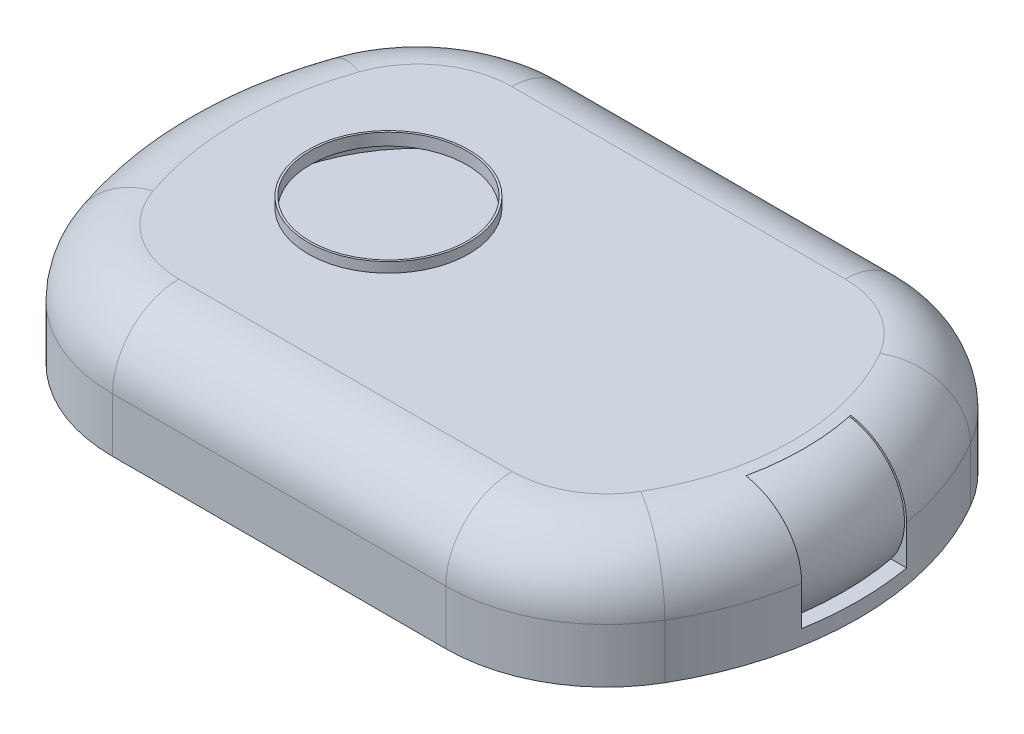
ISO-10303-21;
HEADER;
FILE_DESCRIPTION(('STEP AP214'),'2;1');
FILE_NAME('part.step','',(''),(''),'','','');
FILE_SCHEMA(('AUTOMOTIVE_DESIGN { 1 0 10303 214 1 1 1 1 }'));
ENDSEC;
DATA;
#1=APPLICATION_CONTEXT('core data for automotive mechanical design processes');
#2=APPLICATION_PROTOCOL_DEFINITION('international standard','automotive_design',2000,#1);
#3=PRODUCT_CONTEXT('',#1,'mechanical');
#4=PRODUCT('Part','Part','',(#3));
#5=PRODUCT_RELATED_PRODUCT_CATEGORY('part','',(#4));
#6=PRODUCT_DEFINITION_FORMATION('','',#4);
#7=PRODUCT_DEFINITION_CONTEXT('part definition',#1,'design');
#8=PRODUCT_DEFINITION('design','',#6,#7);
#9=PRODUCT_DEFINITION_SHAPE('','',#8);
#10=(LENGTH_UNIT() NAMED_UNIT(*) SI_UNIT(.MILLI.,.METRE.));
#11=(NAMED_UNIT(*) PLANE_ANGLE_UNIT() SI_UNIT($,.RADIAN.));
#12=(NAMED_UNIT(*) SI_UNIT($,.STERADIAN.) SOLID_ANGLE_UNIT());
#13=UNCERTAINTY_MEASURE_WITH_UNIT(LENGTH_MEASURE(1.E-05),#10,'distance_accuracy_value','');
#14=(GEOMETRIC_REPRESENTATION_CONTEXT(3) GLOBAL_UNCERTAINTY_ASSIGNED_CONTEXT((#13)) GLOBAL_UNIT_ASSIGNED_CONTEXT((#10,
#11,#12)) REPRESENTATION_CONTEXT('',''));
#15=CARTESIAN_POINT('',(0.,0.,0.));
#16=DIRECTION('',(0.,0.,1.));
#17=DIRECTION('',(1.,0.,0.));
#18=AXIS2_PLACEMENT_3D('',#15,#16,#17);
#19=CARTESIAN_POINT('',(0.,203.2,0.));
#20=DIRECTION('',(0.,1.,0.));
#21=DIRECTION('',(0.,0.,1.));
#22=AXIS2_PLACEMENT_3D('',#19,#20,#21);
#23=PLANE('',#22);
#24=CARTESIAN_POINT('',(-209.55,203.2,0.));
#25=DIRECTION('',(0.,1.,0.));
#26=DIRECTION('',(0.,0.,1.));
#27=AXIS2_PLACEMENT_3D('',#24,#25,#26);
#28=CIRCLE('',#27,101.6);
#29=CARTESIAN_POINT('',(-209.55,203.2,101.6));
#30=VERTEX_POINT('',#29);
#31=EDGE_CURVE('E637',#30,#30,#28,.T.);
#32=ORIENTED_EDGE('',*,*,#31,.F.);
#33=EDGE_LOOP('',(#32));
#34=FACE_BOUND('',#33,.T.);
#35=CARTESIAN_POINT('',(-264.032124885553,203.2,91.3859782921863));
#36=DIRECTION('',(0.,1.,0.));
#37=DIRECTION('',(0.,0.,1.));
#38=AXIS2_PLACEMENT_3D('',#35,#36,#37);
#39=CIRCLE('',#38,119.38);
#40=CARTESIAN_POINT('',(-264.032124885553,203.2,210.765978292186));
#41=VERTEX_POINT('',#40);
#42=CARTESIAN_POINT('',(-376.845850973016,203.2,130.432714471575));
#43=VERTEX_POINT('',#42);
#44=EDGE_CURVE('E643',#41,#43,#39,.F.);
#45=ORIENTED_EDGE('',*,*,#44,.F.);
#46=DIRECTION('',(1.,0.,0.));
#47=VECTOR('',#46,1.);
#48=CARTESIAN_POINT('',(248.414392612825,203.2,210.765978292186));
#49=LINE('',#48,#47);
#50=CARTESIAN_POINT('',(157.560554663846,203.2,210.765978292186));
#51=VERTEX_POINT('',#50);
#52=EDGE_CURVE('E578',#41,#51,#49,.T.);
#53=ORIENTED_EDGE('',*,*,#52,.T.);
#54=CARTESIAN_POINT('',(157.560554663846,203.2,91.3859782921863));
#55=DIRECTION('',(0.,1.,0.));
#56=DIRECTION('',(0.,0.,1.));
#57=AXIS2_PLACEMENT_3D('',#54,#55,#56);
#58=CIRCLE('',#57,119.38);
#59=CARTESIAN_POINT('',(260.827734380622,203.2,151.281503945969));
#60=VERTEX_POINT('',#59);
#61=EDGE_CURVE('E608',#60,#51,#58,.F.);
#62=ORIENTED_EDGE('',*,*,#61,.F.);
#63=CARTESIAN_POINT('',(0.,203.2,0.));
#64=DIRECTION('',(0.,1.,0.));
#65=DIRECTION('',(0.,0.,1.));
#66=AXIS2_PLACEMENT_3D('',#63,#64,#65);
#67=CIRCLE('',#66,301.52479244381);
#68=CARTESIAN_POINT('',(260.827734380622,203.2,-151.281503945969));
#69=VERTEX_POINT('',#68);
#70=EDGE_CURVE('E586',#60,#69,#67,.T.);
#71=ORIENTED_EDGE('',*,*,#70,.T.);
#72=CARTESIAN_POINT('',(157.560554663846,203.2,-91.3859782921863));
#73=DIRECTION('',(0.,1.,0.));
#74=DIRECTION('',(0.,0.,1.));
#75=AXIS2_PLACEMENT_3D('',#72,#73,#74);
#76=CIRCLE('',#75,119.38);
#77=CARTESIAN_POINT('',(157.560554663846,203.2,-210.765978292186));
#78=VERTEX_POINT('',#77);
#79=EDGE_CURVE('E606',#78,#69,#76,.F.);
#80=ORIENTED_EDGE('',*,*,#79,.F.);
#81=DIRECTION('',(-1.,0.,0.));
#82=VECTOR('',#81,1.);
#83=CARTESIAN_POINT('',(-382.258893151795,203.2,-210.765978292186));
#84=LINE('',#83,#82);
#85=CARTESIAN_POINT('',(-264.032124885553,203.2,-210.765978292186));
#86=VERTEX_POINT('',#85);
#87=EDGE_CURVE('E592',#78,#86,#84,.T.);
#88=ORIENTED_EDGE('',*,*,#87,.T.);
#89=CARTESIAN_POINT('',(-264.032124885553,203.2,-91.3859782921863));
#90=DIRECTION('',(0.,1.,0.));
#91=DIRECTION('',(0.,0.,1.));
#92=AXIS2_PLACEMENT_3D('',#89,#90,#91);
#93=CIRCLE('',#92,119.38);
#94=CARTESIAN_POINT('',(-376.845850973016,203.2,-130.432714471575));
#95=VERTEX_POINT('',#94);
#96=EDGE_CURVE('E633',#95,#86,#93,.F.);
#97=ORIENTED_EDGE('',*,*,#96,.F.);
#98=CARTESIAN_POINT('',(0.,203.2,0.));
#99=DIRECTION('',(0.,1.,0.));
#100=DIRECTION('',(0.,0.,1.));
#101=AXIS2_PLACEMENT_3D('',#98,#99,#100);
#102=CIRCLE('',#101,398.78);
#103=EDGE_CURVE('E585',#95,#43,#102,.T.);
#104=ORIENTED_EDGE('',*,*,#103,.T.);
#105=EDGE_LOOP('',(#45,#53,#62,#71,#80,#88,#97,#104));
#106=FACE_BOUND('',#105,.T.);
#107=ADVANCED_FACE('F34',(#34,#106),#23,.T.);
#108=CARTESIAN_POINT('',(0.,50.8,0.));
#109=DIRECTION('',(0.,-1.,0.));
#110=DIRECTION('',(0.,0.,-1.));
#111=AXIS2_PLACEMENT_3D('',#108,#109,#110);
#112=CYLINDRICAL_SURFACE('',#111,154.94);
#113=CARTESIAN_POINT('',(0.,50.8,0.));
#114=DIRECTION('',(0.,1.,0.));
#115=DIRECTION('',(0.,0.,1.));
#116=AXIS2_PLACEMENT_3D('',#113,#114,#115);
#117=CIRCLE('',#116,154.94);
#118=CARTESIAN_POINT('',(0.,50.8,154.94));
#119=VERTEX_POINT('',#118);
#120=EDGE_CURVE('E699',#119,#119,#117,.T.);
#121=ORIENTED_EDGE('',*,*,#120,.F.);
#122=EDGE_LOOP('',(#121));
#123=FACE_BOUND('',#122,.T.);
#124=CARTESIAN_POINT('',(0.,0.,0.));
#125=DIRECTION('',(0.,1.,0.));
#126=DIRECTION('',(0.,0.,1.));
#127=AXIS2_PLACEMENT_3D('',#124,#125,#126);
#128=CIRCLE('',#127,154.94);
#129=CARTESIAN_POINT('',(0.,0.,154.94));
#130=VERTEX_POINT('',#129);
#131=EDGE_CURVE('E698',#130,#130,#128,.T.);
#132=ORIENTED_EDGE('',*,*,#131,.T.);
#133=EDGE_LOOP('',(#132));
#134=FACE_BOUND('',#133,.T.);
#135=ADVANCED_FACE('F539',(#123,#134),#112,.T.);
#136=CARTESIAN_POINT('',(0.,0.,0.));
#137=DIRECTION('',(0.,1.,0.));
#138=DIRECTION('',(0.,0.,1.));
#139=AXIS2_PLACEMENT_3D('',#136,#137,#138);
#140=PLANE('',#139);
#141=CARTESIAN_POINT('',(0.,0.,0.));
#142=DIRECTION('',(0.,1.,0.));
#143=DIRECTION('',(0.,0.,1.));
#144=AXIS2_PLACEMENT_3D('',#141,#142,#143);
#145=CIRCLE('',#144,152.4);
#146=CARTESIAN_POINT('',(0.,0.,152.4));
#147=VERTEX_POINT('',#146);
#148=EDGE_CURVE('E331',#147,#147,#145,.T.);
#149=ORIENTED_EDGE('',*,*,#148,.T.);
#150=EDGE_LOOP('',(#149));
#151=FACE_BOUND('',#150,.T.);
#152=ORIENTED_EDGE('',*,*,#131,.F.);
#153=EDGE_LOOP('',(#152));
#154=FACE_BOUND('',#153,.T.);
#155=ADVANCED_FACE('F545',(#151,#154),#140,.F.);
#156=CARTESIAN_POINT('',(0.,50.8,0.));
#157=DIRECTION('',(0.,1.,0.));
#158=DIRECTION('',(0.,0.,1.));
#159=AXIS2_PLACEMENT_3D('',#156,#157,#158);
#160=PLANE('',#159);
#161=CARTESIAN_POINT('',(0.,50.8,0.));
#162=DIRECTION('',(0.,1.,0.));
#163=DIRECTION('',(0.,0.,1.));
#164=AXIS2_PLACEMENT_3D('',#161,#162,#163);
#165=CIRCLE('',#164,482.6);
#166=CARTESIAN_POINT('',(-456.055488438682,50.8,-157.848507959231));
#167=VERTEX_POINT('',#166);
#168=CARTESIAN_POINT('',(-456.055488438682,50.8,157.848507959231));
#169=VERTEX_POINT('',#168);
#170=EDGE_CURVE('E685',#167,#169,#165,.T.);
#171=ORIENTED_EDGE('',*,*,#170,.F.);
#172=CARTESIAN_POINT('',(-264.032124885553,50.8,-91.3859782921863));
#173=DIRECTION('',(0.,1.,0.));
#174=DIRECTION('',(0.,0.,1.));
#175=AXIS2_PLACEMENT_3D('',#172,#173,#174);
#176=CIRCLE('',#175,203.2);
#177=CARTESIAN_POINT('',(-264.032124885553,50.8,-294.585978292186));
#178=VERTEX_POINT('',#177);
#179=EDGE_CURVE('E659',#167,#178,#176,.F.);
#180=ORIENTED_EDGE('',*,*,#179,.T.);
#181=DIRECTION('',(-1.,0.,0.));
#182=VECTOR('',#181,1.);
#183=CARTESIAN_POINT('',(-382.258893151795,50.8,-294.585978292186));
#184=LINE('',#183,#182);
#185=CARTESIAN_POINT('',(157.560554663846,50.8,-294.585978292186));
#186=VERTEX_POINT('',#185);
#187=EDGE_CURVE('E695',#186,#178,#184,.T.);
#188=ORIENTED_EDGE('',*,*,#187,.F.);
#189=CARTESIAN_POINT('',(157.560554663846,50.8,-91.3859782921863));
#190=DIRECTION('',(0.,1.,0.));
#191=DIRECTION('',(0.,0.,1.));
#192=AXIS2_PLACEMENT_3D('',#189,#190,#191);
#193=CIRCLE('',#192,203.2);
#194=CARTESIAN_POINT('',(333.334477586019,50.8,-193.335809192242));
#195=VERTEX_POINT('',#194);
#196=EDGE_CURVE('E622',#186,#195,#193,.F.);
#197=ORIENTED_EDGE('',*,*,#196,.T.);
#198=CARTESIAN_POINT('',(0.,50.8,0.));
#199=DIRECTION('',(0.,1.,0.));
#200=DIRECTION('',(0.,0.,-1.));
#201=AXIS2_PLACEMENT_3D('',#198,#199,#200);
#202=CIRCLE('',#201,385.34479244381);
#203=CARTESIAN_POINT('',(333.334477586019,50.8,193.335809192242));
#204=VERTEX_POINT('',#203);
#205=EDGE_CURVE('E692',#204,#195,#202,.T.);
#206=ORIENTED_EDGE('',*,*,#205,.F.);
#207=CARTESIAN_POINT('',(157.560554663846,50.8,91.3859782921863));
#208=DIRECTION('',(0.,1.,0.));
#209=DIRECTION('',(0.,0.,1.));
#210=AXIS2_PLACEMENT_3D('',#207,#208,#209);
#211=CIRCLE('',#210,203.2);
#212=CARTESIAN_POINT('',(157.560554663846,50.8,294.585978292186));
#213=VERTEX_POINT('',#212);
#214=EDGE_CURVE('E619',#204,#213,#211,.F.);
#215=ORIENTED_EDGE('',*,*,#214,.T.);
#216=DIRECTION('',(1.,0.,0.));
#217=VECTOR('',#216,1.);
#218=CARTESIAN_POINT('',(-382.258893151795,50.8,294.585978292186));
#219=LINE('',#218,#217);
#220=CARTESIAN_POINT('',(-264.032124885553,50.8,294.585978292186));
#221=VERTEX_POINT('',#220);
#222=EDGE_CURVE('E690',#221,#213,#219,.T.);
#223=ORIENTED_EDGE('',*,*,#222,.F.);
#224=CARTESIAN_POINT('',(-264.032124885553,50.8,91.3859782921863));
#225=DIRECTION('',(0.,1.,0.));
#226=DIRECTION('',(0.,0.,1.));
#227=AXIS2_PLACEMENT_3D('',#224,#225,#226);
#228=CIRCLE('',#227,203.2);
#229=EDGE_CURVE('E657',#221,#169,#228,.F.);
#230=ORIENTED_EDGE('',*,*,#229,.T.);
#231=EDGE_LOOP('',(#171,#180,#188,#197,#206,#215,#223,#230));
#232=FACE_BOUND('',#231,.T.);
#233=ORIENTED_EDGE('',*,*,#120,.T.);
#234=EDGE_LOOP('',(#233));
#235=FACE_BOUND('',#234,.T.);
#236=ADVANCED_FACE('F541',(#232,#235),#160,.F.);
#237=CARTESIAN_POINT('',(0.,203.2,0.));
#238=DIRECTION('',(0.,-1.,0.));
#239=DIRECTION('',(0.,0.,-1.));
#240=AXIS2_PLACEMENT_3D('',#237,#238,#239);
#241=CYLINDRICAL_SURFACE('',#240,482.6);
#242=CARTESIAN_POINT('',(0.,119.38,0.));
#243=DIRECTION('',(0.,1.,0.));
#244=DIRECTION('',(0.,0.,1.));
#245=AXIS2_PLACEMENT_3D('',#242,#243,#244);
#246=CIRCLE('',#245,482.6);
#247=CARTESIAN_POINT('',(-456.055488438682,119.38,157.848507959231));
#248=VERTEX_POINT('',#247);
#249=CARTESIAN_POINT('',(-456.055488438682,119.38,-157.848507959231));
#250=VERTEX_POINT('',#249);
#251=EDGE_CURVE('E589',#248,#250,#246,.F.);
#252=ORIENTED_EDGE('',*,*,#251,.T.);
#253=DIRECTION('',(0.,-1.,0.));
#254=VECTOR('',#253,1.);
#255=CARTESIAN_POINT('',(-456.055488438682,203.2,-157.848507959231));
#256=LINE('',#255,#254);
#257=EDGE_CURVE('E655',#250,#167,#256,.T.);
#258=ORIENTED_EDGE('',*,*,#257,.T.);
#259=ORIENTED_EDGE('',*,*,#170,.T.);
#260=DIRECTION('',(0.,-1.,0.));
#261=VECTOR('',#260,1.);
#262=CARTESIAN_POINT('',(-456.055488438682,203.2,157.848507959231));
#263=LINE('',#262,#261);
#264=EDGE_CURVE('E653',#169,#248,#263,.F.);
#265=ORIENTED_EDGE('',*,*,#264,.T.);
#266=EDGE_LOOP('',(#252,#258,#259,#265));
#267=FACE_BOUND('',#266,.T.);
#268=ADVANCED_FACE('F544',(#267),#241,.T.);
#269=CARTESIAN_POINT('',(-382.258893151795,203.2,294.585978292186));
#270=DIRECTION('',(0.,0.,-1.));
#271=DIRECTION('',(-1.,0.,0.));
#272=AXIS2_PLACEMENT_3D('',#269,#270,#271);
#273=PLANE('',#272);
#274=DIRECTION('',(1.,0.,0.));
#275=VECTOR('',#274,1.);
#276=CARTESIAN_POINT('',(-382.258893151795,119.38,294.585978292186));
#277=LINE('',#276,#275);
#278=CARTESIAN_POINT('',(157.560554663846,119.38,294.585978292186));
#279=VERTEX_POINT('',#278);
#280=CARTESIAN_POINT('',(-264.032124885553,119.38,294.585978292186));
#281=VERTEX_POINT('',#280);
#282=EDGE_CURVE('E598',#279,#281,#277,.F.);
#283=ORIENTED_EDGE('',*,*,#282,.T.);
#284=DIRECTION('',(0.,-1.,0.));
#285=VECTOR('',#284,1.);
#286=CARTESIAN_POINT('',(-264.032124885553,203.2,294.585978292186));
#287=LINE('',#286,#285);
#288=EDGE_CURVE('E663',#281,#221,#287,.T.);
#289=ORIENTED_EDGE('',*,*,#288,.T.);
#290=ORIENTED_EDGE('',*,*,#222,.T.);
#291=DIRECTION('',(0.,-1.,0.));
#292=VECTOR('',#291,1.);
#293=CARTESIAN_POINT('',(157.560554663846,203.2,294.585978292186));
#294=LINE('',#293,#292);
#295=EDGE_CURVE('E631',#213,#279,#294,.F.);
#296=ORIENTED_EDGE('',*,*,#295,.T.);
#297=EDGE_LOOP('',(#283,#289,#290,#296));
#298=FACE_BOUND('',#297,.T.);
#299=ADVANCED_FACE('F553',(#298),#273,.F.);
#300=CARTESIAN_POINT('',(0.,203.2,0.));
#301=DIRECTION('',(0.,-1.,0.));
#302=DIRECTION('',(0.,0.,-1.));
#303=AXIS2_PLACEMENT_3D('',#300,#301,#302);
#304=CYLINDRICAL_SURFACE('',#303,385.34479244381);
#305=CARTESIAN_POINT('',(0.,119.38,0.));
#306=DIRECTION('',(0.,1.,0.));
#307=DIRECTION('',(0.,0.,1.));
#308=AXIS2_PLACEMENT_3D('',#305,#306,#307);
#309=CIRCLE('',#308,385.34479244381);
#310=CARTESIAN_POINT('',(333.334477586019,119.38,-193.335809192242));
#311=VERTEX_POINT('',#310);
#312=CARTESIAN_POINT('',(379.592109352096,119.38,-66.335809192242));
#313=VERTEX_POINT('',#312);
#314=EDGE_CURVE('E601',#311,#313,#309,.F.);
#315=ORIENTED_EDGE('',*,*,#314,.T.);
#316=DIRECTION('',(0.,-1.,0.));
#317=VECTOR('',#316,1.);
#318=CARTESIAN_POINT('',(379.592109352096,203.2,-66.335809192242));
#319=LINE('',#318,#317);
#320=CARTESIAN_POINT('',(379.592109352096,69.85,-66.335809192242));
#321=VERTEX_POINT('',#320);
#322=EDGE_CURVE('E49',#313,#321,#319,.T.);
#323=ORIENTED_EDGE('',*,*,#322,.T.);
#324=CARTESIAN_POINT('',(0.,69.85,0.));
#325=DIRECTION('',(0.,-1.,0.));
#326=DIRECTION('',(0.,0.,-1.));
#327=AXIS2_PLACEMENT_3D('',#324,#325,#326);
#328=CIRCLE('',#327,385.34479244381);
#329=CARTESIAN_POINT('',(379.592109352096,69.85,66.335809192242));
#330=VERTEX_POINT('',#329);
#331=EDGE_CURVE('E11',#321,#330,#328,.T.);
#332=ORIENTED_EDGE('',*,*,#331,.T.);
#333=DIRECTION('',(0.,-1.,0.));
#334=VECTOR('',#333,1.);
#335=CARTESIAN_POINT('',(379.592109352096,203.2,66.335809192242));
#336=LINE('',#335,#334);
#337=CARTESIAN_POINT('',(379.592109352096,119.38,66.335809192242));
#338=VERTEX_POINT('',#337);
#339=EDGE_CURVE('E670',#330,#338,#336,.F.);
#340=ORIENTED_EDGE('',*,*,#339,.T.);
#341=CARTESIAN_POINT('',(333.334477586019,119.38,193.335809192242));
#342=VERTEX_POINT('',#341);
#343=EDGE_CURVE('E600',#338,#342,#309,.F.);
#344=ORIENTED_EDGE('',*,*,#343,.T.);
#345=DIRECTION('',(0.,-1.,0.));
#346=VECTOR('',#345,1.);
#347=CARTESIAN_POINT('',(333.334477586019,203.2,193.335809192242));
#348=LINE('',#347,#346);
#349=EDGE_CURVE('E624',#342,#204,#348,.T.);
#350=ORIENTED_EDGE('',*,*,#349,.T.);
#351=ORIENTED_EDGE('',*,*,#205,.T.);
#352=DIRECTION('',(0.,-1.,0.));
#353=VECTOR('',#352,1.);
#354=CARTESIAN_POINT('',(333.334477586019,203.2,-193.335809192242));
#355=LINE('',#354,#353);
#356=EDGE_CURVE('E626',#195,#311,#355,.F.);
#357=ORIENTED_EDGE('',*,*,#356,.T.);
#358=EDGE_LOOP('',(#315,#323,#332,#340,#344,#350,#351,#357));
#359=FACE_BOUND('',#358,.T.);
#360=ADVANCED_FACE('F549',(#359),#304,.T.);
#361=CARTESIAN_POINT('',(-382.258893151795,203.2,-294.585978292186));
#362=DIRECTION('',(0.,0.,1.));
#363=DIRECTION('',(1.,0.,0.));
#364=AXIS2_PLACEMENT_3D('',#361,#362,#363);
#365=PLANE('',#364);
#366=ORIENTED_EDGE('',*,*,#187,.T.);
#367=DIRECTION('',(0.,-1.,0.));
#368=VECTOR('',#367,1.);
#369=CARTESIAN_POINT('',(-264.032124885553,203.2,-294.585978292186));
#370=LINE('',#369,#368);
#371=CARTESIAN_POINT('',(-264.032124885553,119.38,-294.585978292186));
#372=VERTEX_POINT('',#371);
#373=EDGE_CURVE('E661',#178,#372,#370,.F.);
#374=ORIENTED_EDGE('',*,*,#373,.T.);
#375=DIRECTION('',(-1.,0.,0.));
#376=VECTOR('',#375,1.);
#377=CARTESIAN_POINT('',(248.414392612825,119.38,-294.585978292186));
#378=LINE('',#377,#376);
#379=CARTESIAN_POINT('',(157.560554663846,119.38,-294.585978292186));
#380=VERTEX_POINT('',#379);
#381=EDGE_CURVE('E604',#372,#380,#378,.F.);
#382=ORIENTED_EDGE('',*,*,#381,.T.);
#383=DIRECTION('',(0.,-1.,0.));
#384=VECTOR('',#383,1.);
#385=CARTESIAN_POINT('',(157.560554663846,203.2,-294.585978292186));
#386=LINE('',#385,#384);
#387=EDGE_CURVE('E617',#380,#186,#386,.T.);
#388=ORIENTED_EDGE('',*,*,#387,.T.);
#389=EDGE_LOOP('',(#366,#374,#382,#388));
#390=FACE_BOUND('',#389,.T.);
#391=ADVANCED_FACE('F535',(#390),#365,.F.);
#392=CARTESIAN_POINT('',(-209.55,215.9,0.));
#393=DIRECTION('',(0.,-1.,0.));
#394=DIRECTION('',(0.,0.,-1.));
#395=AXIS2_PLACEMENT_3D('',#392,#393,#394);
#396=CYLINDRICAL_SURFACE('',#395,101.6);
#397=CARTESIAN_POINT('',(-209.55,215.9,0.));
#398=DIRECTION('',(0.,1.,0.));
#399=DIRECTION('',(0.,0.,1.));
#400=AXIS2_PLACEMENT_3D('',#397,#398,#399);
#401=CIRCLE('',#400,101.6);
#402=CARTESIAN_POINT('',(-209.55,215.9,101.6));
#403=VERTEX_POINT('',#402);
#404=EDGE_CURVE('E682',#403,#403,#401,.T.);
#405=ORIENTED_EDGE('',*,*,#404,.F.);
#406=EDGE_LOOP('',(#405));
#407=FACE_BOUND('',#406,.T.);
#408=ORIENTED_EDGE('',*,*,#31,.T.);
#409=EDGE_LOOP('',(#408));
#410=FACE_BOUND('',#409,.T.);
#411=ADVANCED_FACE('F531',(#407,#410),#396,.T.);
#412=CARTESIAN_POINT('',(-209.55,215.9,0.));
#413=DIRECTION('',(0.,1.,0.));
#414=DIRECTION('',(0.,0.,1.));
#415=AXIS2_PLACEMENT_3D('',#412,#413,#414);
#416=PLANE('',#415);
#417=CARTESIAN_POINT('',(-209.55,215.9,0.));
#418=DIRECTION('',(0.,1.,0.));
#419=DIRECTION('',(0.,0.,1.));
#420=AXIS2_PLACEMENT_3D('',#417,#418,#419);
#421=CIRCLE('',#420,99.0600000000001);
#422=CARTESIAN_POINT('',(-209.55,215.9,99.0600000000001));
#423=VERTEX_POINT('',#422);
#424=EDGE_CURVE('E324',#423,#423,#421,.T.);
#425=ORIENTED_EDGE('',*,*,#424,.F.);
#426=EDGE_LOOP('',(#425));
#427=FACE_BOUND('',#426,.T.);
#428=ORIENTED_EDGE('',*,*,#404,.T.);
#429=EDGE_LOOP('',(#428));
#430=FACE_BOUND('',#429,.T.);
#431=ADVANCED_FACE('F517',(#427,#430),#416,.T.);
#432=CARTESIAN_POINT('',(0.,119.38,0.));
#433=DIRECTION('',(0.,1.,0.));
#434=DIRECTION('',(0.,0.,1.));
#435=AXIS2_PLACEMENT_3D('',#432,#433,#434);
#436=TOROIDAL_SURFACE('',#435,301.52479244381,83.82);
#437=CARTESIAN_POINT('',(304.41447184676,202.597305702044,66.335809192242));
#438=CARTESIAN_POINT('',(305.618544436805,202.455460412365,66.335809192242));
#439=CARTESIAN_POINT('',(306.819622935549,202.288613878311,66.335809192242));
#440=CARTESIAN_POINT('',(309.21389723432,201.905075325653,66.335809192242));
#441=CARTESIAN_POINT('',(310.407092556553,201.688380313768,66.335809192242));
#442=CARTESIAN_POINT('',(312.783580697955,201.205375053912,66.335809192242));
#443=CARTESIAN_POINT('',(313.966871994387,200.939057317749,66.335809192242));
#444=CARTESIAN_POINT('',(316.321392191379,200.357146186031,66.335809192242));
#445=CARTESIAN_POINT('',(317.492619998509,200.041548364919,66.335809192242));
#446=CARTESIAN_POINT('',(319.821830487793,199.361229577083,66.335809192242));
#447=CARTESIAN_POINT('',(320.97980073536,198.996466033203,66.335809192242));
#448=CARTESIAN_POINT('',(323.279479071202,198.218512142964,66.335809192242));
#449=CARTESIAN_POINT('',(324.421185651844,197.805317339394,66.335809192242));
#450=CARTESIAN_POINT('',(326.685988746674,196.931202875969,66.335809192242));
#451=CARTESIAN_POINT('',(327.809087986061,196.470290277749,66.335809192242));
#452=CARTESIAN_POINT('',(330.034899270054,195.501344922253,66.335809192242));
#453=CARTESIAN_POINT('',(331.137609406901,194.993307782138,66.335809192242));
#454=CARTESIAN_POINT('',(333.320853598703,193.930769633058,66.335809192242));
#455=CARTESIAN_POINT('',(334.401380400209,193.376253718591,66.335809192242));
#456=CARTESIAN_POINT('',(336.537982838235,192.221728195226,66.335809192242));
#457=CARTESIAN_POINT('',(337.594056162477,191.621714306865,66.335809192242));
#458=CARTESIAN_POINT('',(339.679589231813,190.377258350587,66.335809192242));
#459=CARTESIAN_POINT('',(340.709050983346,189.732819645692,66.335809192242));
#460=CARTESIAN_POINT('',(342.739589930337,188.400481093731,66.335809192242));
#461=CARTESIAN_POINT('',(343.740664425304,187.71257713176,66.335809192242));
#462=CARTESIAN_POINT('',(345.712107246,186.294737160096,66.335809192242));
#463=CARTESIAN_POINT('',(346.682485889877,185.564815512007,66.335809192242));
#464=CARTESIAN_POINT('',(348.591047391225,184.063980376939,66.335809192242));
#465=CARTESIAN_POINT('',(349.529227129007,183.293062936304,66.335809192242));
#466=CARTESIAN_POINT('',(352.292500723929,180.920924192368,66.335809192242));
#467=CARTESIAN_POINT('',(354.066912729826,179.259896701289,66.335809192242));
#468=CARTESIAN_POINT('',(357.440318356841,175.816644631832,66.335809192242));
#469=CARTESIAN_POINT('',(359.041514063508,174.036570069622,66.335809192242));
#470=CARTESIAN_POINT('',(362.086055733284,170.346063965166,66.335809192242));
#471=CARTESIAN_POINT('',(363.529402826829,168.435633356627,66.335809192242));
#472=CARTESIAN_POINT('',(366.246917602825,164.498129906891,66.335809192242));
#473=CARTESIAN_POINT('',(367.521091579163,162.471061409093,66.335809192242));
#474=CARTESIAN_POINT('',(369.890364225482,158.314831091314,66.335809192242));
#475=CARTESIAN_POINT('',(370.985464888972,156.185670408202,66.335809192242));
#476=CARTESIAN_POINT('',(372.971206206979,151.87715027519,66.335809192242));
#477=CARTESIAN_POINT('',(373.864956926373,149.699223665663,66.335809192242));
#478=CARTESIAN_POINT('',(375.464089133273,145.275283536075,66.335809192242));
#479=CARTESIAN_POINT('',(376.16947274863,143.029270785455,66.335809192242));
#480=CARTESIAN_POINT('',(377.386384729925,138.485458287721,66.335809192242));
#481=CARTESIAN_POINT('',(377.897923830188,136.18766141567,66.335809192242));
#482=CARTESIAN_POINT('',(378.723226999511,131.556817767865,66.335809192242));
#483=CARTESIAN_POINT('',(379.036991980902,129.223771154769,66.335809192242));
#484=CARTESIAN_POINT('',(379.462130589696,124.563272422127,66.335809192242));
#485=CARTESIAN_POINT('',(379.575531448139,122.236005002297,66.335809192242));
#486=CARTESIAN_POINT('',(379.605309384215,117.580221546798,66.335809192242));
#487=CARTESIAN_POINT('',(379.521688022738,115.251705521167,66.335809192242));
#488=CARTESIAN_POINT('',(379.158067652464,110.610123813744,66.335809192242));
#489=CARTESIAN_POINT('',(378.878073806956,108.297057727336,66.335809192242));
#490=CARTESIAN_POINT('',(378.123852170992,103.702814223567,66.335809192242));
#491=CARTESIAN_POINT('',(377.649624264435,101.421636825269,66.335809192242));
#492=CARTESIAN_POINT('',(376.511942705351,96.9129177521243,66.335809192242));
#493=CARTESIAN_POINT('',(375.84895487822,94.6852585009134,66.335809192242));
#494=CARTESIAN_POINT('',(374.338298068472,90.2934830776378,66.335809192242));
#495=CARTESIAN_POINT('',(373.490629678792,88.1293667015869,66.335809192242));
#496=CARTESIAN_POINT('',(371.616970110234,83.8797597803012,66.335809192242));
#497=CARTESIAN_POINT('',(370.590978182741,81.7942695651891,66.335809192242));
#498=CARTESIAN_POINT('',(368.368321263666,77.7163207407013,66.335809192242));
#499=CARTESIAN_POINT('',(367.171655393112,75.7238626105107,66.335809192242));
#500=CARTESIAN_POINT('',(364.609596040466,71.8350993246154,66.335809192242));
#501=CARTESIAN_POINT('',(363.243326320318,69.9393714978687,66.335809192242));
#502=CARTESIAN_POINT('',(360.357329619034,66.2685900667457,66.335809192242));
#503=CARTESIAN_POINT('',(358.837602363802,64.49353667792,66.335809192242));
#504=CARTESIAN_POINT('',(355.655774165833,61.0759078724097,66.335809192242));
#505=CARTESIAN_POINT('',(353.993668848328,59.4333365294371,66.335809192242));
#506=CARTESIAN_POINT('',(350.539153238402,56.2914814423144,66.335809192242));
#507=CARTESIAN_POINT('',(348.746741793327,54.7921989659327,66.335809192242));
#508=CARTESIAN_POINT('',(345.021076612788,51.9285801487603,66.335809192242));
#509=CARTESIAN_POINT('',(343.08633250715,50.5661827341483,66.335809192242));
#510=CARTESIAN_POINT('',(339.11035153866,48.0068638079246,66.335809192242));
#511=CARTESIAN_POINT('',(337.069113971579,46.8099433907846,66.335809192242));
#512=CARTESIAN_POINT('',(332.894563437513,44.588922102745,66.335809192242));
#513=CARTESIAN_POINT('',(330.761245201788,43.5648311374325,66.335809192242));
#514=CARTESIAN_POINT('',(326.417595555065,41.6956435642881,66.335809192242));
#515=CARTESIAN_POINT('',(324.207263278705,40.8505489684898,66.335809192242));
#516=CARTESIAN_POINT('',(319.684347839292,39.3305481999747,66.335809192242));
#517=CARTESIAN_POINT('',(317.370639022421,38.6589906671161,66.335809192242));
#518=CARTESIAN_POINT('',(312.695512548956,37.5100663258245,66.335809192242));
#519=CARTESIAN_POINT('',(310.334094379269,37.0327016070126,66.335809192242));
#520=CARTESIAN_POINT('',(305.579744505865,36.2744800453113,66.335809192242));
#521=CARTESIAN_POINT('',(303.186810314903,35.9936388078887,66.335809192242));
#522=CARTESIAN_POINT('',(298.385964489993,35.6295672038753,66.335809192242));
#523=CARTESIAN_POINT('',(295.978052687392,35.5463390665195,66.335809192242));
#524=CARTESIAN_POINT('',(291.116157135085,35.5776090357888,66.335809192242));
#525=CARTESIAN_POINT('',(288.6621980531,35.6960255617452,66.335809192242));
#526=CARTESIAN_POINT('',(283.772640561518,36.1366447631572,66.335809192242));
#527=CARTESIAN_POINT('',(281.337042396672,36.4588501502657,66.335809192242));
#528=CARTESIAN_POINT('',(276.50079168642,37.3043941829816,66.335809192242));
#529=CARTESIAN_POINT('',(274.100142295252,37.8277508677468,66.335809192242));
#530=CARTESIAN_POINT('',(269.350512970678,39.0717518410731,66.335809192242));
#531=CARTESIAN_POINT('',(267.001533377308,39.7923974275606,66.335809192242));
#532=CARTESIAN_POINT('',(262.339471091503,41.4373211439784,66.335809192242));
#533=CARTESIAN_POINT('',(260.02733053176,42.3642710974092,66.335809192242));
#534=CARTESIAN_POINT('',(255.489302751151,44.409628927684,66.335809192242));
#535=CARTESIAN_POINT('',(253.26341659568,45.5280391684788,66.335809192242));
#536=CARTESIAN_POINT('',(248.913962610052,47.9490391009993,66.335809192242));
#537=CARTESIAN_POINT('',(246.790400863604,49.251639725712,66.335809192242));
#538=CARTESIAN_POINT('',(242.661577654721,52.0325199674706,66.335809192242));
#539=CARTESIAN_POINT('',(240.656315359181,53.5107983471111,66.335809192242));
#540=CARTESIAN_POINT('',(236.786016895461,56.6282455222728,66.335809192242));
#541=CARTESIAN_POINT('',(234.920534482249,58.2668601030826,66.335809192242));
#542=CARTESIAN_POINT('',(231.337305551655,61.6984554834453,66.335809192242));
#543=CARTESIAN_POINT('',(229.619559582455,63.4914368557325,66.335809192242));
#544=CARTESIAN_POINT('',(226.346389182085,67.2196671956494,66.335809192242));
#545=CARTESIAN_POINT('',(224.790948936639,69.1549022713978,66.335809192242));
#546=CARTESIAN_POINT('',(221.856016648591,73.1545151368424,66.335809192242));
#547=CARTESIAN_POINT('',(220.4765194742,75.2188891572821,66.335809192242));
#548=CARTESIAN_POINT('',(217.943567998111,79.4007401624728,66.335809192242));
#549=CARTESIAN_POINT('',(216.784733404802,81.5149584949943,66.335809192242));
#550=CARTESIAN_POINT('',(214.65605477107,85.8365464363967,66.335809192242));
#551=CARTESIAN_POINT('',(213.686207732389,88.0439145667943,66.335809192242));
#552=CARTESIAN_POINT('',(211.945345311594,92.5351042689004,66.335809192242));
#553=CARTESIAN_POINT('',(211.174278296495,94.81890581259,66.335809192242));
#554=CARTESIAN_POINT('',(209.838690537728,99.446129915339,66.335809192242));
#555=CARTESIAN_POINT('',(209.274162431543,101.789550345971,66.335809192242));
#556=CARTESIAN_POINT('',(208.37759797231,106.415096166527,66.335809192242));
#557=CARTESIAN_POINT('',(208.036548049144,108.695478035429,66.335809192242));
#558=CARTESIAN_POINT('',(207.552504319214,113.277144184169,66.335809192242));
#559=CARTESIAN_POINT('',(207.409504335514,115.578427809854,66.335809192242));
#560=CARTESIAN_POINT('',(207.323038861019,120.184402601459,66.335809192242));
#561=CARTESIAN_POINT('',(207.379544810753,122.489093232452,66.335809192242));
#562=CARTESIAN_POINT('',(207.691441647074,127.084963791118,66.335809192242));
#563=CARTESIAN_POINT('',(207.946830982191,129.376143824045,66.335809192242));
#564=CARTESIAN_POINT('',(208.64533692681,133.87314396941,66.335809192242));
#565=CARTESIAN_POINT('',(209.083786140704,136.079691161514,66.335809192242));
#566=CARTESIAN_POINT('',(210.143378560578,140.448402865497,66.335809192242));
#567=CARTESIAN_POINT('',(210.764517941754,142.610568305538,66.335809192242));
#568=CARTESIAN_POINT('',(212.183767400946,146.876067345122,66.335809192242));
#569=CARTESIAN_POINT('',(212.981885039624,148.979398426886,66.335809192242));
#570=CARTESIAN_POINT('',(214.747987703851,153.113475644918,66.335809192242));
#571=CARTESIAN_POINT('',(215.715976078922,155.144220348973,66.335809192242));
#572=CARTESIAN_POINT('',(217.830973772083,159.153278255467,66.335809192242));
#573=CARTESIAN_POINT('',(218.980679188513,161.130168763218,66.335809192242));
#574=CARTESIAN_POINT('',(221.437586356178,164.983464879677,66.335809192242));
#575=CARTESIAN_POINT('',(222.744789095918,166.859869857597,66.335809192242));
#576=CARTESIAN_POINT('',(225.506541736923,170.501152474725,66.335809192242));
#577=CARTESIAN_POINT('',(226.961106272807,172.266019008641,66.335809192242));
#578=CARTESIAN_POINT('',(230.006633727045,175.673837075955,66.335809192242));
#579=CARTESIAN_POINT('',(231.597600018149,177.316785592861,66.335809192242));
#580=CARTESIAN_POINT('',(234.972600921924,180.536329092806,66.335809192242));
#581=CARTESIAN_POINT('',(236.76188147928,182.107427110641,66.335809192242));
#582=CARTESIAN_POINT('',(240.462941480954,185.098059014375,66.335809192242));
#583=CARTESIAN_POINT('',(242.374724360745,186.51758864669,66.335809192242));
#584=CARTESIAN_POINT('',(246.307960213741,189.197145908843,66.335809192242));
#585=CARTESIAN_POINT('',(248.329455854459,190.457110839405,66.335809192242));
#586=CARTESIAN_POINT('',(252.467955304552,192.809559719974,66.335809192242));
#587=CARTESIAN_POINT('',(254.584959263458,193.902043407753,66.335809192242));
#588=CARTESIAN_POINT('',(257.859034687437,195.427781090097,66.335809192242));
#589=CARTESIAN_POINT('',(258.986780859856,195.924907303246,66.335809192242));
#590=CARTESIAN_POINT('',(261.261998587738,196.871684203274,66.335809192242));
#591=CARTESIAN_POINT('',(262.409468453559,197.321338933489,66.335809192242));
#592=CARTESIAN_POINT('',(264.722334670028,198.172500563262,66.335809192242));
#593=CARTESIAN_POINT('',(265.887734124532,198.573999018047,66.335809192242));
#594=CARTESIAN_POINT('',(268.234146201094,199.32805472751,66.335809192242));
#595=CARTESIAN_POINT('',(269.415157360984,199.680616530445,66.335809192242));
#596=CARTESIAN_POINT('',(271.789768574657,200.335931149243,66.335809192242));
#597=CARTESIAN_POINT('',(272.983356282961,200.638728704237,66.335809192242));
#598=CARTESIAN_POINT('',(275.381995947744,201.194335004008,66.335809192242));
#599=CARTESIAN_POINT('',(276.587046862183,201.447148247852,66.335809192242));
#600=CARTESIAN_POINT('',(279.006437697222,201.902310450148,66.335809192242));
#601=CARTESIAN_POINT('',(280.220776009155,202.104667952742,66.335809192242));
#602=CARTESIAN_POINT('',(282.656731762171,202.458563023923,66.335809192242));
#603=CARTESIAN_POINT('',(283.878348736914,202.610103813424,66.335809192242));
#604=CARTESIAN_POINT('',(286.706886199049,202.901160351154,66.335809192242));
#605=CARTESIAN_POINT('',(288.315727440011,203.022349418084,66.335809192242));
#606=CARTESIAN_POINT('',(291.537263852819,203.176372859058,66.335809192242));
#607=CARTESIAN_POINT('',(293.149958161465,203.209225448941,66.335809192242));
#608=CARTESIAN_POINT('',(296.374737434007,203.186338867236,66.335809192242));
#609=CARTESIAN_POINT('',(297.986822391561,203.1305987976,66.335809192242));
#610=CARTESIAN_POINT('',(301.205862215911,202.930432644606,66.335809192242));
#611=CARTESIAN_POINT('',(302.812815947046,202.785988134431,66.335809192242));
#612=CARTESIAN_POINT('',(304.41447184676,202.597305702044,66.335809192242));
#613=B_SPLINE_CURVE_WITH_KNOTS('',3,(#437,#438,#439,#440,#441,#442,#443,#444,#445,#446,#447,
#448,#449,#450,#451,#452,#453,#454,#455,#456,#457,#458,#459,#460,#461,#462,#463,#464,#465,#466,
#467,#468,#469,#470,#471,#472,#473,#474,#475,#476,#477,#478,#479,#480,#481,#482,#483,#484,#485,
#486,#487,#488,#489,#490,#491,#492,#493,#494,#495,#496,#497,#498,#499,#500,#501,#502,#503,#504,
#505,#506,#507,#508,#509,#510,#511,#512,#513,#514,#515,#516,#517,#518,#519,#520,#521,#522,#523,
#524,#525,#526,#527,#528,#529,#530,#531,#532,#533,#534,#535,#536,#537,#538,#539,#540,#541,#542,
#543,#544,#545,#546,#547,#548,#549,#550,#551,#552,#553,#554,#555,#556,#557,#558,#559,#560,#561,
#562,#563,#564,#565,#566,#567,#568,#569,#570,#571,#572,#573,#574,#575,#576,#577,#578,#579,#580,
#581,#582,#583,#584,#585,#586,#587,#588,#589,#590,#591,#592,#593,#594,#595,#596,#597,#598,#599,
#600,#601,#602,#603,#604,#605,#606,#607,#608,#609,#610,#611,#612),.UNSPECIFIED.,.T.,.F.,(4,2,2,
2,2,2,2,2,2,2,2,2,2,2,2,2,2,2,2,2,2,2,2,2,2,2,2,2,2,2,2,2,2,2,2,2,2,2,2,2,2,2,2,2,2,2,2,2,2,2,2,
2,2,2,2,2,2,2,2,2,2,2,2,2,2,2,2,2,2,2,2,2,2,2,2,2,2,2,2,2,2,2,2,2,2,2,2,4),(0.,3.63684988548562,
7.27391821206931,10.9115358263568,14.549480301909,18.1905956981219,21.832046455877,
25.4729590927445,29.1142106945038,32.7566345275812,36.3994013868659,40.041892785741,
43.6847295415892,47.3263284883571,50.968279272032,58.2500309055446,65.4243346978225,
72.5985871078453,79.7725725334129,86.9464780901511,94.0005368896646,101.054516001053,
108.108104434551,115.161660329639,122.143432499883,129.125149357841,136.10668265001,
143.088220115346,150.052675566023,157.017108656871,163.981570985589,170.946069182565,
177.948175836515,184.950294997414,191.952629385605,198.955025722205,206.045675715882,
213.13637260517,220.227475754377,227.318658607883,234.537886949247,241.757192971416,
248.977072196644,256.197032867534,263.558900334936,270.920865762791,278.283491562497,
285.646165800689,293.11040223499,300.574730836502,308.039502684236,315.504221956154,
322.943993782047,330.383793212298,337.822867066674,345.26172389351,352.485606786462,
359.709375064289,366.931265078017,374.152897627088,381.061632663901,387.970152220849,
394.877682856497,401.785159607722,408.526344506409,415.267388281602,422.008720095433,
428.750184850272,435.603149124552,442.456156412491,449.309844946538,456.163702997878,
463.299069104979,470.434635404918,477.572996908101,484.711369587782,488.407845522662,
492.104006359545,495.800814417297,499.497278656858,503.190401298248,506.883191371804,
510.575355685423,514.267285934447,519.10496278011,523.941641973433,528.778370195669,
533.616103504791),.UNSPECIFIED.);
#614=CARTESIAN_POINT('',(309.020820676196,201.93,66.335809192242));
#615=VERTEX_POINT('',#614);
#616=EDGE_CURVE('E42',#615,#338,#613,.T.);
#617=ORIENTED_EDGE('',*,*,#616,.F.);
#618=CARTESIAN_POINT('',(0.,201.93,0.));
#619=DIRECTION('',(0.,1.,0.));
#620=DIRECTION('',(0.,0.,1.));
#621=AXIS2_PLACEMENT_3D('',#618,#619,#620);
#622=CIRCLE('',#621,316.060606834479);
#623=CARTESIAN_POINT('',(309.020820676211,201.93,-66.335809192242));
#624=VERTEX_POINT('',#623);
#625=EDGE_CURVE('E508',#624,#615,#622,.F.);
#626=ORIENTED_EDGE('',*,*,#625,.F.);
#627=CARTESIAN_POINT('',(304.41447184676,202.597305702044,-66.335809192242));
#628=CARTESIAN_POINT('',(303.181922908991,202.74250819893,-66.335809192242));
#629=CARTESIAN_POINT('',(301.94631313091,202.86150486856,-66.335809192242));
#630=CARTESIAN_POINT('',(299.471047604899,203.047005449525,-66.335809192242));
#631=CARTESIAN_POINT('',(298.231391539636,203.113505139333,-66.335809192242));
#632=CARTESIAN_POINT('',(295.750109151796,203.193990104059,-66.335809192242));
#633=CARTESIAN_POINT('',(294.508482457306,203.207963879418,-66.335809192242));
#634=CARTESIAN_POINT('',(292.025630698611,203.183438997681,-66.335809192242));
#635=CARTESIAN_POINT('',(290.784405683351,203.144935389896,-66.335809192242));
#636=CARTESIAN_POINT('',(288.303185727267,203.015526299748,-66.335809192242));
#637=CARTESIAN_POINT('',(287.06319409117,202.924557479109,-66.335809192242));
#638=CARTESIAN_POINT('',(284.588034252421,202.690398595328,-66.335809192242));
#639=CARTESIAN_POINT('',(283.352866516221,202.547203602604,-66.335809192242));
#640=CARTESIAN_POINT('',(280.889871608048,202.208942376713,-66.335809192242));
#641=CARTESIAN_POINT('',(279.662043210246,202.013885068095,-66.335809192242));
#642=CARTESIAN_POINT('',(277.215566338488,201.57226421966,-66.335809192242));
#643=CARTESIAN_POINT('',(275.996918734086,201.325695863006,-66.335809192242));
#644=CARTESIAN_POINT('',(273.572137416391,200.781775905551,-66.335809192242));
#645=CARTESIAN_POINT('',(272.365993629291,200.484469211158,-66.335809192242));
#646=CARTESIAN_POINT('',(269.967143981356,199.839437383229,-66.335809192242));
#647=CARTESIAN_POINT('',(268.774439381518,199.491707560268,-66.335809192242));
#648=CARTESIAN_POINT('',(266.404772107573,198.746492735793,-66.335809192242));
#649=CARTESIAN_POINT('',(265.227808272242,198.349011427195,-66.335809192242));
#650=CARTESIAN_POINT('',(262.891512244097,197.504924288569,-66.335809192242));
#651=CARTESIAN_POINT('',(261.73218169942,197.058313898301,-66.335809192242));
#652=CARTESIAN_POINT('',(259.433704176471,196.116903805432,-66.335809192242));
#653=CARTESIAN_POINT('',(258.294550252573,195.622121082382,-66.335809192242));
#654=CARTESIAN_POINT('',(256.038033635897,194.585067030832,-66.335809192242));
#655=CARTESIAN_POINT('',(254.920672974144,194.042791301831,-66.335809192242));
#656=CARTESIAN_POINT('',(251.60454588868,192.346109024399,-66.335809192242));
#657=CARTESIAN_POINT('',(249.44110933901,191.121591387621,-66.335809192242));
#658=CARTESIAN_POINT('',(245.220011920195,188.490556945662,-66.335809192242));
#659=CARTESIAN_POINT('',(243.162657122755,187.083550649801,-66.335809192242));
#660=CARTESIAN_POINT('',(239.175346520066,184.099079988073,-66.335809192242));
#661=CARTESIAN_POINT('',(237.245391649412,182.521614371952,-66.335809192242));
#662=CARTESIAN_POINT('',(233.528202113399,179.206512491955,-66.335809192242));
#663=CARTESIAN_POINT('',(231.740971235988,177.468871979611,-66.335809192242));
#664=CARTESIAN_POINT('',(228.324081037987,173.844974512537,-66.335809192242));
#665=CARTESIAN_POINT('',(226.694418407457,171.958720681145,-66.335809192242));
#666=CARTESIAN_POINT('',(223.637411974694,168.089092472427,-66.335809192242));
#667=CARTESIAN_POINT('',(222.206705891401,166.108374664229,-66.335809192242));
#668=CARTESIAN_POINT('',(219.523047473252,162.029893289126,-66.335809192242));
#669=CARTESIAN_POINT('',(218.27009368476,159.932130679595,-66.335809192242));
#670=CARTESIAN_POINT('',(215.954005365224,155.634866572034,-66.335809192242));
#671=CARTESIAN_POINT('',(214.890827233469,153.435388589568,-66.335809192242));
#672=CARTESIAN_POINT('',(212.964552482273,148.950482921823,-66.335809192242));
#673=CARTESIAN_POINT('',(212.101448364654,146.665058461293,-66.335809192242));
#674=CARTESIAN_POINT('',(210.615697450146,142.1217071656,-66.335809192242));
#675=CARTESIAN_POINT('',(209.984590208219,139.866544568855,-66.335809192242));
#676=CARTESIAN_POINT('',(208.920894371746,135.309870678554,-66.335809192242));
#677=CARTESIAN_POINT('',(208.488300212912,133.008360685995,-66.335809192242));
#678=CARTESIAN_POINT('',(207.826193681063,128.376799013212,-66.335809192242));
#679=CARTESIAN_POINT('',(207.596638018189,126.046753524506,-66.335809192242));
#680=CARTESIAN_POINT('',(207.34289504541,121.37551641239,-66.335809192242));
#681=CARTESIAN_POINT('',(207.318703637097,119.034325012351,-66.335809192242));
#682=CARTESIAN_POINT('',(207.473175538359,114.440618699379,-66.335809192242));
#683=CARTESIAN_POINT('',(207.64478185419,112.187863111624,-66.335809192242));
#684=CARTESIAN_POINT('',(208.177759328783,107.704974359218,-66.335809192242));
#685=CARTESIAN_POINT('',(208.539125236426,105.474840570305,-66.335809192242));
#686=CARTESIAN_POINT('',(209.448086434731,101.052928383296,-66.335809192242));
#687=CARTESIAN_POINT('',(209.995678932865,98.8611494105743,-66.335809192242));
#688=CARTESIAN_POINT('',(211.271904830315,94.5309654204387,-66.335809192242));
#689=CARTESIAN_POINT('',(212.000540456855,92.3925610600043,-66.335809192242));
#690=CARTESIAN_POINT('',(213.633958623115,88.1788578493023,-66.335809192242));
#691=CARTESIAN_POINT('',(214.539118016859,86.1037051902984,-66.335809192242));
#692=CARTESIAN_POINT('',(216.516638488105,82.0347324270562,-66.335809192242));
#693=CARTESIAN_POINT('',(217.588998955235,80.0409120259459,-66.335809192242));
#694=CARTESIAN_POINT('',(219.892129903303,76.1467210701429,-66.335809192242));
#695=CARTESIAN_POINT('',(221.122918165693,74.2463610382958,-66.335809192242));
#696=CARTESIAN_POINT('',(223.733111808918,70.5506216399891,-66.335809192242));
#697=CARTESIAN_POINT('',(225.112521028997,68.7552449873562,-66.335809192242));
#698=CARTESIAN_POINT('',(228.061841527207,65.2171994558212,-66.335809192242));
#699=CARTESIAN_POINT('',(229.636824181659,63.4787568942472,-66.335809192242));
#700=CARTESIAN_POINT('',(232.923239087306,60.1360592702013,-66.335809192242));
#701=CARTESIAN_POINT('',(234.634674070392,58.5318068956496,-66.335809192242));
#702=CARTESIAN_POINT('',(238.181843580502,55.4666360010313,-66.335809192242));
#703=CARTESIAN_POINT('',(240.01759733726,54.0057397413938,-66.335809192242));
#704=CARTESIAN_POINT('',(243.800405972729,51.2359707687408,-66.335809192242));
#705=CARTESIAN_POINT('',(245.747463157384,49.9271012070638,-66.335809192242));
#706=CARTESIAN_POINT('',(249.820060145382,47.4195051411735,-66.335809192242));
#707=CARTESIAN_POINT('',(251.94962779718,46.2273154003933,-66.335809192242));
#708=CARTESIAN_POINT('',(256.300031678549,44.0230218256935,-66.335809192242));
#709=CARTESIAN_POINT('',(258.520870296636,43.0109227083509,-66.335809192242));
#710=CARTESIAN_POINT('',(263.038673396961,41.173177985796,-66.335809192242));
#711=CARTESIAN_POINT('',(265.33564593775,40.3475521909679,-66.335809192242));
#712=CARTESIAN_POINT('',(269.989797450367,38.8883298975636,-66.335809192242));
#713=CARTESIAN_POINT('',(272.3469768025,38.2547346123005,-66.335809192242));
#714=CARTESIAN_POINT('',(277.154390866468,37.172983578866,-66.335809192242));
#715=CARTESIAN_POINT('',(279.605542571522,36.728897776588,-66.335809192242));
#716=CARTESIAN_POINT('',(284.536585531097,36.0488030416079,-66.335809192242));
#717=CARTESIAN_POINT('',(287.016477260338,35.8127975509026,-66.335809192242));
#718=CARTESIAN_POINT('',(291.987395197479,35.5511278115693,-66.335809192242));
#719=CARTESIAN_POINT('',(294.478421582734,35.5254669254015,-66.335809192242));
#720=CARTESIAN_POINT('',(299.453685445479,35.6854426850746,-66.335809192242));
#721=CARTESIAN_POINT('',(301.937922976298,35.8710776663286,-66.335809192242));
#722=CARTESIAN_POINT('',(306.874665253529,36.4523847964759,-66.335809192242));
#723=CARTESIAN_POINT('',(309.327239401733,36.8474670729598,-66.335809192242));
#724=CARTESIAN_POINT('',(314.189777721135,37.845429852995,-66.335809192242));
#725=CARTESIAN_POINT('',(316.599741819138,38.4483107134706,-66.335809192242));
#726=CARTESIAN_POINT('',(321.359002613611,39.8584560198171,-66.335809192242));
#727=CARTESIAN_POINT('',(323.708302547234,40.6657095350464,-66.335809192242));
#728=CARTESIAN_POINT('',(328.328594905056,42.4796920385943,-66.335809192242));
#729=CARTESIAN_POINT('',(330.599588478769,43.4864180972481,-66.335809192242));
#730=CARTESIAN_POINT('',(335.008586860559,45.6743562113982,-66.335809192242));
#731=CARTESIAN_POINT('',(337.148181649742,46.8523647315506,-66.335809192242));
#732=CARTESIAN_POINT('',(341.31866532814,49.3872675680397,-66.335809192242));
#733=CARTESIAN_POINT('',(343.349555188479,50.7441602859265,-66.335809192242));
#734=CARTESIAN_POINT('',(347.286906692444,53.6275655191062,-66.335809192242));
#735=CARTESIAN_POINT('',(349.193378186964,55.154064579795,-66.335809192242));
#736=CARTESIAN_POINT('',(352.867227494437,58.3661648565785,-66.335809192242));
#737=CARTESIAN_POINT('',(354.634607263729,60.0517638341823,-66.335809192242));
#738=CARTESIAN_POINT('',(357.982425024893,63.5347641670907,-66.335809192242));
#739=CARTESIAN_POINT('',(359.565900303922,65.3292468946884,-66.335809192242));
#740=CARTESIAN_POINT('',(362.57376659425,69.0469304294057,-66.335809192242));
#741=CARTESIAN_POINT('',(363.998159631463,70.9701295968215,-66.335809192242));
#742=CARTESIAN_POINT('',(366.67672401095,74.9314294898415,-66.335809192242));
#743=CARTESIAN_POINT('',(367.930908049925,76.9695216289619,-66.335809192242));
#744=CARTESIAN_POINT('',(370.259355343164,81.1460214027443,-66.335809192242));
#745=CARTESIAN_POINT('',(371.33362034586,83.2844280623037,-66.335809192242));
#746=CARTESIAN_POINT('',(373.277478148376,87.6096968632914,-66.335809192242));
#747=CARTESIAN_POINT('',(374.150171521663,89.7951660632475,-66.335809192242));
#748=CARTESIAN_POINT('',(375.706654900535,94.2323633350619,-66.335809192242));
#749=CARTESIAN_POINT('',(376.390447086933,96.4840906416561,-66.335809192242));
#750=CARTESIAN_POINT('',(377.563815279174,101.037475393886,-66.335809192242));
#751=CARTESIAN_POINT('',(378.053401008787,103.339130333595,-66.335809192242));
#752=CARTESIAN_POINT('',(378.834602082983,107.975797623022,-66.335809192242));
#753=CARTESIAN_POINT('',(379.126218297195,110.310809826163,-66.335809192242));
#754=CARTESIAN_POINT('',(379.507301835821,114.973800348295,-66.335809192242));
#755=CARTESIAN_POINT('',(379.598756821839,117.301616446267,-66.335809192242));
#756=CARTESIAN_POINT('',(379.584710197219,121.956642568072,-66.335809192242));
#757=CARTESIAN_POINT('',(379.479210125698,124.283852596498,-66.335809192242));
#758=CARTESIAN_POINT('',(379.072065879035,128.920996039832,-66.335809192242));
#759=CARTESIAN_POINT('',(378.770425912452,131.230929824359,-66.335809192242));
#760=CARTESIAN_POINT('',(377.973308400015,135.817104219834,-66.335809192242));
#761=CARTESIAN_POINT('',(377.47783071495,138.093344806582,-66.335809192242));
#762=CARTESIAN_POINT('',(376.298113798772,142.590989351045,-66.335809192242));
#763=CARTESIAN_POINT('',(375.614293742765,144.812503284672,-66.335809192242));
#764=CARTESIAN_POINT('',(374.062593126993,149.190267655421,-66.335809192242));
#765=CARTESIAN_POINT('',(373.194713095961,151.346518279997,-66.335809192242));
#766=CARTESIAN_POINT('',(371.281419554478,155.578674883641,-66.335809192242));
#767=CARTESIAN_POINT('',(370.236012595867,157.654583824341,-66.335809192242));
#768=CARTESIAN_POINT('',(367.975499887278,161.711747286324,-66.335809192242));
#769=CARTESIAN_POINT('',(366.760393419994,163.693001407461,-66.335809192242));
#770=CARTESIAN_POINT('',(364.162059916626,167.558265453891,-66.335809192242));
#771=CARTESIAN_POINT('',(362.777944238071,169.441680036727,-66.335809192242));
#772=CARTESIAN_POINT('',(360.587925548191,172.174832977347,-66.335809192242));
#773=CARTESIAN_POINT('',(359.838836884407,173.070669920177,-66.335809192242));
#774=CARTESIAN_POINT('',(358.303994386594,174.830325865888,-66.335809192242));
#775=CARTESIAN_POINT('',(357.518243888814,175.694147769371,-66.335809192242));
#776=CARTESIAN_POINT('',(355.911198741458,177.388662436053,-66.335809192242));
#777=CARTESIAN_POINT('',(355.089890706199,178.219342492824,-66.335809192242));
#778=CARTESIAN_POINT('',(353.413560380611,179.845810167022,-66.335809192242));
#779=CARTESIAN_POINT('',(352.558541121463,180.641600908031,-66.335809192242));
#780=CARTESIAN_POINT('',(350.816195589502,182.197131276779,-66.335809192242));
#781=CARTESIAN_POINT('',(349.928866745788,182.956868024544,-66.335809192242));
#782=CARTESIAN_POINT('',(348.123636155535,184.438937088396,-66.335809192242));
#783=CARTESIAN_POINT('',(347.205737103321,185.161272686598,-66.335809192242));
#784=CARTESIAN_POINT('',(345.328486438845,186.576844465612,-66.335809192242));
#785=CARTESIAN_POINT('',(344.368745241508,187.269564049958,-66.335809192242));
#786=CARTESIAN_POINT('',(342.42129842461,188.614317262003,-66.335809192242));
#787=CARTESIAN_POINT('',(341.433595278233,189.26635447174,-66.335809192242));
#788=CARTESIAN_POINT('',(339.431759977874,190.528879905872,-66.335809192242));
#789=CARTESIAN_POINT('',(338.417623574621,191.139361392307,-66.335809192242));
#790=CARTESIAN_POINT('',(336.364982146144,192.317654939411,-66.335809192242));
#791=CARTESIAN_POINT('',(335.326479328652,192.885470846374,-66.335809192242));
#792=CARTESIAN_POINT('',(333.227874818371,193.977096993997,-66.335809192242));
#793=CARTESIAN_POINT('',(332.167794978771,194.500949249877,-66.335809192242));
#794=CARTESIAN_POINT('',(330.027023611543,195.504431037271,-66.335809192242));
#795=CARTESIAN_POINT('',(328.946333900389,195.984064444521,-66.335809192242));
#796=CARTESIAN_POINT('',(326.766329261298,196.898375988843,-66.335809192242));
#797=CARTESIAN_POINT('',(325.667017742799,197.33306225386,-66.335809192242));
#798=CARTESIAN_POINT('',(323.451575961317,198.156923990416,-66.335809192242));
#799=CARTESIAN_POINT('',(322.335446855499,198.546102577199,-66.335809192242));
#800=CARTESIAN_POINT('',(319.846896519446,199.357079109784,-66.335809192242));
#801=CARTESIAN_POINT('',(318.470896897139,199.767941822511,-66.335809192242));
#802=CARTESIAN_POINT('',(315.700554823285,200.520866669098,-66.335809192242));
#803=CARTESIAN_POINT('',(314.306216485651,200.862943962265,-66.335809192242));
#804=CARTESIAN_POINT('',(311.502358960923,201.477780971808,-66.335809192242));
#805=CARTESIAN_POINT('',(310.092839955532,201.750541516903,-66.335809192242));
#806=CARTESIAN_POINT('',(307.261738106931,202.226334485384,-66.335809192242));
#807=CARTESIAN_POINT('',(305.840152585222,202.429350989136,-66.335809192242));
#808=CARTESIAN_POINT('',(304.41447184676,202.597305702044,-66.335809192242));
#809=B_SPLINE_CURVE_WITH_KNOTS('',3,(#627,#628,#629,#630,#631,#632,#633,#634,#635,#636,#637,
#638,#639,#640,#641,#642,#643,#644,#645,#646,#647,#648,#649,#650,#651,#652,#653,#654,#655,#656,
#657,#658,#659,#660,#661,#662,#663,#664,#665,#666,#667,#668,#669,#670,#671,#672,#673,#674,#675,
#676,#677,#678,#679,#680,#681,#682,#683,#684,#685,#686,#687,#688,#689,#690,#691,#692,#693,#694,
#695,#696,#697,#698,#699,#700,#701,#702,#703,#704,#705,#706,#707,#708,#709,#710,#711,#712,#713,
#714,#715,#716,#717,#718,#719,#720,#721,#722,#723,#724,#725,#726,#727,#728,#729,#730,#731,#732,
#733,#734,#735,#736,#737,#738,#739,#740,#741,#742,#743,#744,#745,#746,#747,#748,#749,#750,#751,
#752,#753,#754,#755,#756,#757,#758,#759,#760,#761,#762,#763,#764,#765,#766,#767,#768,#769,#770,
#771,#772,#773,#774,#775,#776,#777,#778,#779,#780,#781,#782,#783,#784,#785,#786,#787,#788,#789,
#790,#791,#792,#793,#794,#795,#796,#797,#798,#799,#800,#801,#802,#803,#804,#805,#806,#807,#808),
.UNSPECIFIED.,.T.,.F.,(4,2,2,2,2,2,2,2,2,2,2,2,2,2,2,2,2,2,2,2,2,2,2,2,2,2,2,2,2,2,2,2,2,2,2,2,
2,2,2,2,2,2,2,2,2,2,2,2,2,2,2,2,2,2,2,2,2,2,2,2,2,2,2,2,2,2,2,2,2,2,2,2,2,2,2,2,2,2,2,2,2,2,2,2,
2,2,2,2,2,2,4),(0.,3.72289295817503,7.44608526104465,11.1700926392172,14.8944513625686,
18.6233157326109,22.3525321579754,26.081107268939,29.8100311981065,33.5356717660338,
37.2616590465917,40.9873699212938,44.7134269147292,48.4381752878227,52.1632691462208,
59.6114370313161,67.0800131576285,74.5486440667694,82.017473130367,89.4861452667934,
96.8071944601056,104.128183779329,111.447488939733,118.766519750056,125.783199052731,
132.79968166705,139.814667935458,146.829514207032,153.599304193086,160.368906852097,
167.138408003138,173.907992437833,180.692190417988,187.476363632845,194.261298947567,
201.046409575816,208.075859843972,215.105450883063,222.136131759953,229.166958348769,
236.480222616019,243.793678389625,251.107910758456,258.422189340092,265.886485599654,
273.350905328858,280.815444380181,288.279924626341,295.723493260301,303.167074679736,
310.610258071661,318.053332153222,325.37179032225,332.69018310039,340.007995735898,
347.325705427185,354.496720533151,361.667644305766,368.838032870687,376.008351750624,
383.059684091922,390.110935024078,397.161832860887,404.212699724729,411.193225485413,
418.173696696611,425.154018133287,432.134344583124,439.099259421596,446.064154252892,
453.02879209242,459.993459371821,466.996465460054,470.498909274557,474.001034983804,
477.504490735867,481.007632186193,484.511052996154,488.014165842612,491.564000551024,
495.113522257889,498.663618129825,502.213393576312,505.75973699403,509.30576928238,
512.851159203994,516.396306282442,520.70257003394,525.007883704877,529.313145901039,
533.619390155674),.UNSPECIFIED.);
#810=EDGE_CURVE('E502',#313,#624,#809,.T.);
#811=ORIENTED_EDGE('',*,*,#810,.F.);
#812=ORIENTED_EDGE('',*,*,#314,.F.);
#813=CARTESIAN_POINT('',(260.827734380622,119.38,-151.281503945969));
#814=DIRECTION('',(0.501721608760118,0.,0.86502914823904));
#815=DIRECTION('',(0.86502914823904,0.,-0.501721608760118));
#816=AXIS2_PLACEMENT_3D('',#813,#814,#815);
#817=CIRCLE('',#816,83.82);
#818=EDGE_CURVE('E614',#311,#69,#817,.T.);
#819=ORIENTED_EDGE('',*,*,#818,.T.);
#820=ORIENTED_EDGE('',*,*,#70,.F.);
#821=CARTESIAN_POINT('',(260.827734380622,119.38,151.281503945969));
#822=DIRECTION('',(0.501721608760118,0.,-0.86502914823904));
#823=DIRECTION('',(-0.86502914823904,0.,-0.501721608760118));
#824=AXIS2_PLACEMENT_3D('',#821,#822,#823);
#825=CIRCLE('',#824,83.82);
#826=EDGE_CURVE('E611',#60,#342,#825,.T.);
#827=ORIENTED_EDGE('',*,*,#826,.T.);
#828=ORIENTED_EDGE('',*,*,#343,.F.);
#829=EDGE_LOOP('',(#617,#626,#811,#812,#819,#820,#827,#828));
#830=FACE_BOUND('',#829,.T.);
#831=ADVANCED_FACE('F511',(#830),#436,.T.);
#832=CARTESIAN_POINT('',(0.,119.38,-210.765978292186));
#833=DIRECTION('',(1.,0.,0.));
#834=DIRECTION('',(0.,0.,-1.));
#835=AXIS2_PLACEMENT_3D('',#832,#833,#834);
#836=CYLINDRICAL_SURFACE('',#835,83.82);
#837=ORIENTED_EDGE('',*,*,#381,.F.);
#838=CARTESIAN_POINT('',(-264.032124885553,119.38,-210.765978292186));
#839=DIRECTION('',(1.,0.,0.));
#840=DIRECTION('',(0.,0.,-1.));
#841=AXIS2_PLACEMENT_3D('',#838,#839,#840);
#842=CIRCLE('',#841,83.82);
#843=EDGE_CURVE('E650',#372,#86,#842,.T.);
#844=ORIENTED_EDGE('',*,*,#843,.T.);
#845=ORIENTED_EDGE('',*,*,#87,.F.);
#846=CARTESIAN_POINT('',(157.560554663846,119.38,-210.765978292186));
#847=DIRECTION('',(-1.,0.,0.));
#848=DIRECTION('',(0.,0.,1.));
#849=AXIS2_PLACEMENT_3D('',#846,#847,#848);
#850=CIRCLE('',#849,83.82);
#851=EDGE_CURVE('E628',#78,#380,#850,.T.);
#852=ORIENTED_EDGE('',*,*,#851,.T.);
#853=EDGE_LOOP('',(#837,#844,#845,#852));
#854=FACE_BOUND('',#853,.T.);
#855=ADVANCED_FACE('F516',(#854),#836,.T.);
#856=CARTESIAN_POINT('',(0.,119.38,210.765978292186));
#857=DIRECTION('',(-1.,0.,0.));
#858=DIRECTION('',(0.,0.,1.));
#859=AXIS2_PLACEMENT_3D('',#856,#857,#858);
#860=CYLINDRICAL_SURFACE('',#859,83.82);
#861=ORIENTED_EDGE('',*,*,#52,.F.);
#862=CARTESIAN_POINT('',(-264.032124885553,119.38,210.765978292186));
#863=DIRECTION('',(1.,0.,0.));
#864=DIRECTION('',(0.,0.,-1.));
#865=AXIS2_PLACEMENT_3D('',#862,#863,#864);
#866=CIRCLE('',#865,83.82);
#867=EDGE_CURVE('E57',#41,#281,#866,.T.);
#868=ORIENTED_EDGE('',*,*,#867,.T.);
#869=ORIENTED_EDGE('',*,*,#282,.F.);
#870=CARTESIAN_POINT('',(157.560554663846,119.38,210.765978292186));
#871=DIRECTION('',(-1.,0.,0.));
#872=DIRECTION('',(0.,0.,1.));
#873=AXIS2_PLACEMENT_3D('',#870,#871,#872);
#874=CIRCLE('',#873,83.82);
#875=EDGE_CURVE('E580',#279,#51,#874,.T.);
#876=ORIENTED_EDGE('',*,*,#875,.T.);
#877=EDGE_LOOP('',(#861,#868,#869,#876));
#878=FACE_BOUND('',#877,.T.);
#879=ADVANCED_FACE('F570',(#878),#860,.T.);
#880=CARTESIAN_POINT('',(0.,119.38,0.));
#881=DIRECTION('',(0.,1.,0.));
#882=DIRECTION('',(0.,0.,1.));
#883=AXIS2_PLACEMENT_3D('',#880,#881,#882);
#884=TOROIDAL_SURFACE('',#883,398.78,83.82);
#885=ORIENTED_EDGE('',*,*,#251,.F.);
#886=CARTESIAN_POINT('',(-376.845850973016,119.38,130.432714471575));
#887=DIRECTION('',(-0.327079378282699,0.,-0.944996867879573));
#888=DIRECTION('',(-0.944996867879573,0.,0.327079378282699));
#889=AXIS2_PLACEMENT_3D('',#886,#887,#888);
#890=CIRCLE('',#889,83.82);
#891=EDGE_CURVE('E648',#248,#43,#890,.T.);
#892=ORIENTED_EDGE('',*,*,#891,.T.);
#893=ORIENTED_EDGE('',*,*,#103,.F.);
#894=CARTESIAN_POINT('',(-376.845850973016,119.38,-130.432714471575));
#895=DIRECTION('',(-0.327079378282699,0.,0.944996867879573));
#896=DIRECTION('',(0.944996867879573,0.,0.327079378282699));
#897=AXIS2_PLACEMENT_3D('',#894,#895,#896);
#898=CIRCLE('',#897,83.82);
#899=EDGE_CURVE('E646',#95,#250,#898,.T.);
#900=ORIENTED_EDGE('',*,*,#899,.T.);
#901=EDGE_LOOP('',(#885,#892,#893,#900));
#902=FACE_BOUND('',#901,.T.);
#903=ADVANCED_FACE('F567',(#902),#884,.T.);
#904=CARTESIAN_POINT('',(157.560554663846,203.2,91.3859782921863));
#905=DIRECTION('',(0.,-1.,0.));
#906=DIRECTION('',(0.,0.,-1.));
#907=AXIS2_PLACEMENT_3D('',#904,#905,#906);
#908=CYLINDRICAL_SURFACE('',#907,203.2);
#909=ORIENTED_EDGE('',*,*,#214,.F.);
#910=ORIENTED_EDGE('',*,*,#349,.F.);
#911=CARTESIAN_POINT('',(157.560554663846,119.38,91.3859782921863));
#912=DIRECTION('',(0.,1.,0.));
#913=DIRECTION('',(0.,0.,1.));
#914=AXIS2_PLACEMENT_3D('',#911,#912,#913);
#915=CIRCLE('',#914,203.2);
#916=EDGE_CURVE('E634',#279,#342,#915,.T.);
#917=ORIENTED_EDGE('',*,*,#916,.F.);
#918=ORIENTED_EDGE('',*,*,#295,.F.);
#919=EDGE_LOOP('',(#909,#910,#917,#918));
#920=FACE_BOUND('',#919,.T.);
#921=ADVANCED_FACE('F569',(#920),#908,.T.);
#922=CARTESIAN_POINT('',(157.560554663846,119.38,91.3859782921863));
#923=DIRECTION('',(0.,1.,0.));
#924=DIRECTION('',(0.,0.,1.));
#925=AXIS2_PLACEMENT_3D('',#922,#923,#924);
#926=TOROIDAL_SURFACE('',#925,119.38,83.82);
#927=ORIENTED_EDGE('',*,*,#826,.F.);
#928=ORIENTED_EDGE('',*,*,#61,.T.);
#929=ORIENTED_EDGE('',*,*,#875,.F.);
#930=ORIENTED_EDGE('',*,*,#916,.T.);
#931=EDGE_LOOP('',(#927,#928,#929,#930));
#932=FACE_BOUND('',#931,.T.);
#933=ADVANCED_FACE('F520',(#932),#926,.T.);
#934=CARTESIAN_POINT('',(157.560554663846,203.2,-91.3859782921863));
#935=DIRECTION('',(0.,-1.,0.));
#936=DIRECTION('',(0.,0.,-1.));
#937=AXIS2_PLACEMENT_3D('',#934,#935,#936);
#938=CYLINDRICAL_SURFACE('',#937,203.2);
#939=ORIENTED_EDGE('',*,*,#196,.F.);
#940=ORIENTED_EDGE('',*,*,#387,.F.);
#941=CARTESIAN_POINT('',(157.560554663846,119.38,-91.3859782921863));
#942=DIRECTION('',(0.,1.,0.));
#943=DIRECTION('',(0.,0.,1.));
#944=AXIS2_PLACEMENT_3D('',#941,#942,#943);
#945=CIRCLE('',#944,203.2);
#946=EDGE_CURVE('E638',#311,#380,#945,.T.);
#947=ORIENTED_EDGE('',*,*,#946,.F.);
#948=ORIENTED_EDGE('',*,*,#356,.F.);
#949=EDGE_LOOP('',(#939,#940,#947,#948));
#950=FACE_BOUND('',#949,.T.);
#951=ADVANCED_FACE('F716',(#950),#938,.T.);
#952=CARTESIAN_POINT('',(157.560554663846,119.38,-91.3859782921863));
#953=DIRECTION('',(0.,1.,0.));
#954=DIRECTION('',(0.,0.,1.));
#955=AXIS2_PLACEMENT_3D('',#952,#953,#954);
#956=TOROIDAL_SURFACE('',#955,119.38,83.82);
#957=ORIENTED_EDGE('',*,*,#818,.F.);
#958=ORIENTED_EDGE('',*,*,#946,.T.);
#959=ORIENTED_EDGE('',*,*,#851,.F.);
#960=ORIENTED_EDGE('',*,*,#79,.T.);
#961=EDGE_LOOP('',(#957,#958,#959,#960));
#962=FACE_BOUND('',#961,.T.);
#963=ADVANCED_FACE('F711',(#962),#956,.T.);
#964=CARTESIAN_POINT('',(-264.032124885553,203.2,91.3859782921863));
#965=DIRECTION('',(0.,-1.,0.));
#966=DIRECTION('',(0.,0.,-1.));
#967=AXIS2_PLACEMENT_3D('',#964,#965,#966);
#968=CYLINDRICAL_SURFACE('',#967,203.2);
#969=ORIENTED_EDGE('',*,*,#229,.F.);
#970=ORIENTED_EDGE('',*,*,#288,.F.);
#971=CARTESIAN_POINT('',(-264.032124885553,119.38,91.3859782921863));
#972=DIRECTION('',(0.,1.,0.));
#973=DIRECTION('',(0.,0.,1.));
#974=AXIS2_PLACEMENT_3D('',#971,#972,#973);
#975=CIRCLE('',#974,203.2);
#976=EDGE_CURVE('E641',#248,#281,#975,.T.);
#977=ORIENTED_EDGE('',*,*,#976,.F.);
#978=ORIENTED_EDGE('',*,*,#264,.F.);
#979=EDGE_LOOP('',(#969,#970,#977,#978));
#980=FACE_BOUND('',#979,.T.);
#981=ADVANCED_FACE('F730',(#980),#968,.T.);
#982=CARTESIAN_POINT('',(-264.032124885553,119.38,91.3859782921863));
#983=DIRECTION('',(0.,1.,0.));
#984=DIRECTION('',(0.,0.,1.));
#985=AXIS2_PLACEMENT_3D('',#982,#983,#984);
#986=TOROIDAL_SURFACE('',#985,119.38,83.82);
#987=ORIENTED_EDGE('',*,*,#867,.F.);
#988=ORIENTED_EDGE('',*,*,#44,.T.);
#989=ORIENTED_EDGE('',*,*,#891,.F.);
#990=ORIENTED_EDGE('',*,*,#976,.T.);
#991=EDGE_LOOP('',(#987,#988,#989,#990));
#992=FACE_BOUND('',#991,.T.);
#993=ADVANCED_FACE('F732',(#992),#986,.T.);
#994=CARTESIAN_POINT('',(-264.032124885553,203.2,-91.3859782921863));
#995=DIRECTION('',(0.,-1.,0.));
#996=DIRECTION('',(0.,0.,-1.));
#997=AXIS2_PLACEMENT_3D('',#994,#995,#996);
#998=CYLINDRICAL_SURFACE('',#997,203.2);
#999=ORIENTED_EDGE('',*,*,#179,.F.);
#1000=ORIENTED_EDGE('',*,*,#257,.F.);
#1001=CARTESIAN_POINT('',(-264.032124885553,119.38,-91.3859782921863));
#1002=DIRECTION('',(0.,1.,0.));
#1003=DIRECTION('',(0.,0.,1.));
#1004=AXIS2_PLACEMENT_3D('',#1001,#1002,#1003);
#1005=CIRCLE('',#1004,203.2);
#1006=EDGE_CURVE('E509',#372,#250,#1005,.T.);
#1007=ORIENTED_EDGE('',*,*,#1006,.F.);
#1008=ORIENTED_EDGE('',*,*,#373,.F.);
#1009=EDGE_LOOP('',(#999,#1000,#1007,#1008));
#1010=FACE_BOUND('',#1009,.T.);
#1011=ADVANCED_FACE('F36',(#1010),#998,.T.);
#1012=CARTESIAN_POINT('',(-264.032124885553,119.38,-91.3859782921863));
#1013=DIRECTION('',(0.,1.,0.));
#1014=DIRECTION('',(0.,0.,1.));
#1015=AXIS2_PLACEMENT_3D('',#1012,#1013,#1014);
#1016=TOROIDAL_SURFACE('',#1015,119.38,83.82);
#1017=ORIENTED_EDGE('',*,*,#843,.F.);
#1018=ORIENTED_EDGE('',*,*,#1006,.T.);
#1019=ORIENTED_EDGE('',*,*,#899,.F.);
#1020=ORIENTED_EDGE('',*,*,#96,.T.);
#1021=EDGE_LOOP('',(#1017,#1018,#1019,#1020));
#1022=FACE_BOUND('',#1021,.T.);
#1023=ADVANCED_FACE('F725',(#1022),#1016,.T.);
#1024=CARTESIAN_POINT('',(291.36479244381,69.85,66.335809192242));
#1025=DIRECTION('',(0.,-1.,0.));
#1026=DIRECTION('',(0.,0.,-1.));
#1027=AXIS2_PLACEMENT_3D('',#1024,#1025,#1026);
#1028=PLANE('',#1027);
#1029=DIRECTION('',(1.,0.,0.));
#1030=VECTOR('',#1029,1.);
#1031=CARTESIAN_POINT('',(291.36479244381,69.85,-66.335809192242));
#1032=LINE('',#1031,#1030);
#1033=CARTESIAN_POINT('',(291.36479244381,69.85,-66.335809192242));
#1034=VERTEX_POINT('',#1033);
#1035=EDGE_CURVE('E750',#1034,#321,#1032,.T.);
#1036=ORIENTED_EDGE('',*,*,#1035,.F.);
#1037=DIRECTION('',(0.,0.,-1.));
#1038=VECTOR('',#1037,1.);
#1039=CARTESIAN_POINT('',(291.36479244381,69.85,66.335809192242));
#1040=LINE('',#1039,#1038);
#1041=CARTESIAN_POINT('',(291.36479244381,69.85,66.335809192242));
#1042=VERTEX_POINT('',#1041);
#1043=EDGE_CURVE('E754',#1042,#1034,#1040,.T.);
#1044=ORIENTED_EDGE('',*,*,#1043,.F.);
#1045=DIRECTION('',(1.,0.,0.));
#1046=VECTOR('',#1045,1.);
#1047=CARTESIAN_POINT('',(291.36479244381,69.85,66.335809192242));
#1048=LINE('',#1047,#1046);
#1049=EDGE_CURVE('E757',#1042,#330,#1048,.T.);
#1050=ORIENTED_EDGE('',*,*,#1049,.T.);
#1051=ORIENTED_EDGE('',*,*,#331,.F.);
#1052=EDGE_LOOP('',(#1036,#1044,#1050,#1051));
#1053=FACE_BOUND('',#1052,.T.);
#1054=ADVANCED_FACE('F499',(#1053),#1028,.F.);
#1055=CARTESIAN_POINT('',(291.36479244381,201.93,66.335809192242));
#1056=DIRECTION('',(0.,0.,1.));
#1057=DIRECTION('',(0.,-1.,0.));
#1058=AXIS2_PLACEMENT_3D('',#1055,#1056,#1057);
#1059=PLANE('',#1058);
#1060=ORIENTED_EDGE('',*,*,#1049,.F.);
#1061=DIRECTION('',(0.,-1.,0.));
#1062=VECTOR('',#1061,1.);
#1063=CARTESIAN_POINT('',(291.36479244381,201.93,66.335809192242));
#1064=LINE('',#1063,#1062);
#1065=CARTESIAN_POINT('',(291.36479244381,201.93,66.335809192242));
#1066=VERTEX_POINT('',#1065);
#1067=EDGE_CURVE('E404',#1066,#1042,#1064,.T.);
#1068=ORIENTED_EDGE('',*,*,#1067,.F.);
#1069=DIRECTION('',(1.,0.,0.));
#1070=VECTOR('',#1069,1.);
#1071=CARTESIAN_POINT('',(291.36479244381,201.93,66.335809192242));
#1072=LINE('',#1071,#1070);
#1073=EDGE_CURVE('E678',#1066,#615,#1072,.T.);
#1074=ORIENTED_EDGE('',*,*,#1073,.T.);
#1075=ORIENTED_EDGE('',*,*,#616,.T.);
#1076=ORIENTED_EDGE('',*,*,#339,.F.);
#1077=EDGE_LOOP('',(#1060,#1068,#1074,#1075,#1076));
#1078=FACE_BOUND('',#1077,.T.);
#1079=ADVANCED_FACE('F498',(#1078),#1059,.F.);
#1080=CARTESIAN_POINT('',(291.36479244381,201.93,-66.335809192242));
#1081=DIRECTION('',(0.,0.,-1.));
#1082=DIRECTION('',(-1.,0.,0.));
#1083=AXIS2_PLACEMENT_3D('',#1080,#1081,#1082);
#1084=PLANE('',#1083);
#1085=ORIENTED_EDGE('',*,*,#810,.T.);
#1086=DIRECTION('',(1.,0.,0.));
#1087=VECTOR('',#1086,1.);
#1088=CARTESIAN_POINT('',(291.36479244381,201.93,-66.335809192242));
#1089=LINE('',#1088,#1087);
#1090=CARTESIAN_POINT('',(291.36479244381,201.93,-66.335809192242));
#1091=VERTEX_POINT('',#1090);
#1092=EDGE_CURVE('E756',#1091,#624,#1089,.T.);
#1093=ORIENTED_EDGE('',*,*,#1092,.F.);
#1094=DIRECTION('',(0.,1.,0.));
#1095=VECTOR('',#1094,1.);
#1096=CARTESIAN_POINT('',(291.36479244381,201.93,-66.335809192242));
#1097=LINE('',#1096,#1095);
#1098=EDGE_CURVE('E760',#1034,#1091,#1097,.T.);
#1099=ORIENTED_EDGE('',*,*,#1098,.F.);
#1100=ORIENTED_EDGE('',*,*,#1035,.T.);
#1101=ORIENTED_EDGE('',*,*,#322,.F.);
#1102=EDGE_LOOP('',(#1085,#1093,#1099,#1100,#1101));
#1103=FACE_BOUND('',#1102,.T.);
#1104=ADVANCED_FACE('F493',(#1103),#1084,.F.);
#1105=CARTESIAN_POINT('',(291.36479244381,201.93,66.335809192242));
#1106=DIRECTION('',(0.,1.,0.));
#1107=DIRECTION('',(0.,0.,1.));
#1108=AXIS2_PLACEMENT_3D('',#1105,#1106,#1107);
#1109=PLANE('',#1108);
#1110=ORIENTED_EDGE('',*,*,#625,.T.);
#1111=ORIENTED_EDGE('',*,*,#1073,.F.);
#1112=DIRECTION('',(0.,0.,1.));
#1113=VECTOR('',#1112,1.);
#1114=CARTESIAN_POINT('',(291.36479244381,201.93,66.335809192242));
#1115=LINE('',#1114,#1113);
#1116=EDGE_CURVE('E764',#1091,#1066,#1115,.T.);
#1117=ORIENTED_EDGE('',*,*,#1116,.F.);
#1118=ORIENTED_EDGE('',*,*,#1092,.T.);
#1119=EDGE_LOOP('',(#1110,#1111,#1117,#1118));
#1120=FACE_BOUND('',#1119,.T.);
#1121=ADVANCED_FACE('F489',(#1120),#1109,.F.);
#1122=CARTESIAN_POINT('',(291.36479244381,69.85,66.335809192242));
#1123=DIRECTION('',(1.,0.,0.));
#1124=DIRECTION('',(0.,0.,-1.));
#1125=AXIS2_PLACEMENT_3D('',#1122,#1123,#1124);
#1126=PLANE('',#1125);
#1127=ORIENTED_EDGE('',*,*,#1067,.T.);
#1128=ORIENTED_EDGE('',*,*,#1043,.T.);
#1129=ORIENTED_EDGE('',*,*,#1098,.T.);
#1130=ORIENTED_EDGE('',*,*,#1116,.T.);
#1131=EDGE_LOOP('',(#1127,#1128,#1129,#1130));
#1132=FACE_BOUND('',#1131,.T.);
#1133=ADVANCED_FACE('F416',(#1132),#1126,.T.);
#1134=CARTESIAN_POINT('',(0.,200.66,0.));
#1135=DIRECTION('',(0.,1.,0.));
#1136=DIRECTION('',(0.,0.,1.));
#1137=AXIS2_PLACEMENT_3D('',#1134,#1135,#1136);
#1138=PLANE('',#1137);
#1139=CARTESIAN_POINT('',(-209.55,200.66,0.));
#1140=DIRECTION('',(0.,1.,0.));
#1141=DIRECTION('',(0.,0.,1.));
#1142=AXIS2_PLACEMENT_3D('',#1139,#1140,#1141);
#1143=CIRCLE('',#1142,99.0600000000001);
#1144=CARTESIAN_POINT('',(-209.55,200.66,99.0600000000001));
#1145=VERTEX_POINT('',#1144);
#1146=EDGE_CURVE('E362',#1145,#1145,#1143,.T.);
#1147=ORIENTED_EDGE('',*,*,#1146,.T.);
#1148=EDGE_LOOP('',(#1147));
#1149=FACE_BOUND('',#1148,.T.);
#1150=CARTESIAN_POINT('',(-264.032124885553,200.66,91.3859782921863));
#1151=DIRECTION('',(0.,1.,0.));
#1152=DIRECTION('',(0.,0.,1.));
#1153=AXIS2_PLACEMENT_3D('',#1150,#1151,#1152);
#1154=CIRCLE('',#1153,119.38);
#1155=CARTESIAN_POINT('',(-264.032124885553,200.66,210.765978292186));
#1156=VERTEX_POINT('',#1155);
#1157=CARTESIAN_POINT('',(-376.845850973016,200.66,130.432714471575));
#1158=VERTEX_POINT('',#1157);
#1159=EDGE_CURVE('E288',#1156,#1158,#1154,.F.);
#1160=ORIENTED_EDGE('',*,*,#1159,.T.);
#1161=CARTESIAN_POINT('',(0.,200.66,0.));
#1162=DIRECTION('',(0.,1.,0.));
#1163=DIRECTION('',(0.,0.,1.));
#1164=AXIS2_PLACEMENT_3D('',#1161,#1162,#1163);
#1165=CIRCLE('',#1164,398.78);
#1166=CARTESIAN_POINT('',(-376.845850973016,200.66,-130.432714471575));
#1167=VERTEX_POINT('',#1166);
#1168=EDGE_CURVE('E258',#1167,#1158,#1165,.T.);
#1169=ORIENTED_EDGE('',*,*,#1168,.F.);
#1170=CARTESIAN_POINT('',(-264.032124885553,200.66,-91.3859782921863));
#1171=DIRECTION('',(0.,1.,0.));
#1172=DIRECTION('',(0.,0.,1.));
#1173=AXIS2_PLACEMENT_3D('',#1170,#1171,#1172);
#1174=CIRCLE('',#1173,119.38);
#1175=CARTESIAN_POINT('',(-264.032124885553,200.66,-210.765978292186));
#1176=VERTEX_POINT('',#1175);
#1177=EDGE_CURVE('E286',#1167,#1176,#1174,.F.);
#1178=ORIENTED_EDGE('',*,*,#1177,.T.);
#1179=DIRECTION('',(1.,0.,0.));
#1180=VECTOR('',#1179,1.);
#1181=CARTESIAN_POINT('',(0.,200.66,-210.765978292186));
#1182=LINE('',#1181,#1180);
#1183=CARTESIAN_POINT('',(157.560554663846,200.66,-210.765978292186));
#1184=VERTEX_POINT('',#1183);
#1185=EDGE_CURVE('E282',#1184,#1176,#1182,.F.);
#1186=ORIENTED_EDGE('',*,*,#1185,.F.);
#1187=CARTESIAN_POINT('',(157.560554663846,200.66,-91.3859782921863));
#1188=DIRECTION('',(0.,1.,0.));
#1189=DIRECTION('',(0.,0.,1.));
#1190=AXIS2_PLACEMENT_3D('',#1187,#1188,#1189);
#1191=CIRCLE('',#1190,119.38);
#1192=CARTESIAN_POINT('',(260.827734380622,200.66,-151.281503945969));
#1193=VERTEX_POINT('',#1192);
#1194=EDGE_CURVE('E273',#1184,#1193,#1191,.F.);
#1195=ORIENTED_EDGE('',*,*,#1194,.T.);
#1196=CARTESIAN_POINT('',(0.,200.66,0.));
#1197=DIRECTION('',(0.,1.,0.));
#1198=DIRECTION('',(0.,0.,1.));
#1199=AXIS2_PLACEMENT_3D('',#1196,#1197,#1198);
#1200=CIRCLE('',#1199,301.52479244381);
#1201=CARTESIAN_POINT('',(288.82479244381,200.66,-86.5877573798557));
#1202=VERTEX_POINT('',#1201);
#1203=EDGE_CURVE('E280',#1202,#1193,#1200,.T.);
#1204=ORIENTED_EDGE('',*,*,#1203,.F.);
#1205=CARTESIAN_POINT('',(260.827734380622,200.66,151.281503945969));
#1206=VERTEX_POINT('',#1205);
#1207=EDGE_CURVE('E259',#1206,#1202,#1200,.T.);
#1208=ORIENTED_EDGE('',*,*,#1207,.F.);
#1209=CARTESIAN_POINT('',(157.560554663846,200.66,91.3859782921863));
#1210=DIRECTION('',(0.,1.,0.));
#1211=DIRECTION('',(0.,0.,1.));
#1212=AXIS2_PLACEMENT_3D('',#1209,#1210,#1211);
#1213=CIRCLE('',#1212,119.38);
#1214=CARTESIAN_POINT('',(157.560554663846,200.66,210.765978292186));
#1215=VERTEX_POINT('',#1214);
#1216=EDGE_CURVE('E265',#1206,#1215,#1213,.F.);
#1217=ORIENTED_EDGE('',*,*,#1216,.T.);
#1218=DIRECTION('',(1.,0.,0.));
#1219=VECTOR('',#1218,1.);
#1220=CARTESIAN_POINT('',(0.,200.66,210.765978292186));
#1221=LINE('',#1220,#1219);
#1222=EDGE_CURVE('E248',#1156,#1215,#1221,.T.);
#1223=ORIENTED_EDGE('',*,*,#1222,.F.);
#1224=EDGE_LOOP('',(#1160,#1169,#1178,#1186,#1195,#1204,#1208,#1217,#1223));
#1225=FACE_BOUND('',#1224,.T.);
#1226=ADVANCED_FACE('F270',(#1149,#1225),#1138,.F.);
#1227=CARTESIAN_POINT('',(0.,50.8,0.));
#1228=DIRECTION('',(0.,-1.,0.));
#1229=DIRECTION('',(0.,0.,-1.));
#1230=AXIS2_PLACEMENT_3D('',#1227,#1228,#1229);
#1231=CYLINDRICAL_SURFACE('',#1230,152.4);
#1232=CARTESIAN_POINT('',(0.,53.34,0.));
#1233=DIRECTION('',(0.,1.,0.));
#1234=DIRECTION('',(0.,0.,1.));
#1235=AXIS2_PLACEMENT_3D('',#1232,#1233,#1234);
#1236=CIRCLE('',#1235,152.4);
#1237=CARTESIAN_POINT('',(0.,53.34,152.4));
#1238=VERTEX_POINT('',#1237);
#1239=EDGE_CURVE('E285',#1238,#1238,#1236,.T.);
#1240=ORIENTED_EDGE('',*,*,#1239,.T.);
#1241=EDGE_LOOP('',(#1240));
#1242=FACE_BOUND('',#1241,.T.);
#1243=ORIENTED_EDGE('',*,*,#148,.F.);
#1244=EDGE_LOOP('',(#1243));
#1245=FACE_BOUND('',#1244,.T.);
#1246=ADVANCED_FACE('F415',(#1242,#1245),#1231,.F.);
#1247=CARTESIAN_POINT('',(0.,53.34,0.));
#1248=DIRECTION('',(0.,1.,0.));
#1249=DIRECTION('',(0.,0.,1.));
#1250=AXIS2_PLACEMENT_3D('',#1247,#1248,#1249);
#1251=PLANE('',#1250);
#1252=CARTESIAN_POINT('',(0.,53.34,0.));
#1253=DIRECTION('',(0.,1.,0.));
#1254=DIRECTION('',(0.,0.,1.));
#1255=AXIS2_PLACEMENT_3D('',#1252,#1253,#1254);
#1256=CIRCLE('',#1255,480.06);
#1257=CARTESIAN_POINT('',(-453.655196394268,53.34,-157.017726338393));
#1258=VERTEX_POINT('',#1257);
#1259=CARTESIAN_POINT('',(-453.655196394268,53.34,157.017726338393));
#1260=VERTEX_POINT('',#1259);
#1261=EDGE_CURVE('E321',#1258,#1260,#1256,.T.);
#1262=ORIENTED_EDGE('',*,*,#1261,.T.);
#1263=CARTESIAN_POINT('',(-264.032124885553,53.34,91.3859782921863));
#1264=DIRECTION('',(0.,1.,0.));
#1265=DIRECTION('',(0.,0.,1.));
#1266=AXIS2_PLACEMENT_3D('',#1263,#1264,#1265);
#1267=CIRCLE('',#1266,200.66);
#1268=CARTESIAN_POINT('',(-264.032124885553,53.34,292.045978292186));
#1269=VERTEX_POINT('',#1268);
#1270=EDGE_CURVE('E328',#1269,#1260,#1267,.F.);
#1271=ORIENTED_EDGE('',*,*,#1270,.F.);
#1272=DIRECTION('',(1.,0.,0.));
#1273=VECTOR('',#1272,1.);
#1274=CARTESIAN_POINT('',(-382.258893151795,53.34,292.045978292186));
#1275=LINE('',#1274,#1273);
#1276=CARTESIAN_POINT('',(157.560554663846,53.34,292.045978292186));
#1277=VERTEX_POINT('',#1276);
#1278=EDGE_CURVE('E317',#1269,#1277,#1275,.T.);
#1279=ORIENTED_EDGE('',*,*,#1278,.T.);
#1280=CARTESIAN_POINT('',(157.560554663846,53.34,91.3859782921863));
#1281=DIRECTION('',(0.,1.,0.));
#1282=DIRECTION('',(0.,0.,1.));
#1283=AXIS2_PLACEMENT_3D('',#1280,#1281,#1282);
#1284=CIRCLE('',#1283,200.66);
#1285=CARTESIAN_POINT('',(331.137303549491,53.34,192.061436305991));
#1286=VERTEX_POINT('',#1285);
#1287=EDGE_CURVE('E333',#1286,#1277,#1284,.F.);
#1288=ORIENTED_EDGE('',*,*,#1287,.F.);
#1289=CARTESIAN_POINT('',(0.,53.34,0.));
#1290=DIRECTION('',(0.,1.,0.));
#1291=DIRECTION('',(0.,0.,1.));
#1292=AXIS2_PLACEMENT_3D('',#1289,#1290,#1291);
#1293=CIRCLE('',#1292,382.80479244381);
#1294=CARTESIAN_POINT('',(331.137303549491,53.34,-192.061436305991));
#1295=VERTEX_POINT('',#1294);
#1296=EDGE_CURVE('E313',#1286,#1295,#1293,.T.);
#1297=ORIENTED_EDGE('',*,*,#1296,.T.);
#1298=CARTESIAN_POINT('',(157.560554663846,53.34,-91.3859782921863));
#1299=DIRECTION('',(0.,1.,0.));
#1300=DIRECTION('',(0.,0.,1.));
#1301=AXIS2_PLACEMENT_3D('',#1298,#1299,#1300);
#1302=CIRCLE('',#1301,200.66);
#1303=CARTESIAN_POINT('',(157.560554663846,53.34,-292.045978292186));
#1304=VERTEX_POINT('',#1303);
#1305=EDGE_CURVE('E312',#1304,#1295,#1302,.F.);
#1306=ORIENTED_EDGE('',*,*,#1305,.F.);
#1307=DIRECTION('',(-1.,0.,0.));
#1308=VECTOR('',#1307,1.);
#1309=CARTESIAN_POINT('',(-382.258893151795,53.34,-292.045978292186));
#1310=LINE('',#1309,#1308);
#1311=CARTESIAN_POINT('',(-264.032124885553,53.34,-292.045978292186));
#1312=VERTEX_POINT('',#1311);
#1313=EDGE_CURVE('E316',#1304,#1312,#1310,.T.);
#1314=ORIENTED_EDGE('',*,*,#1313,.T.);
#1315=CARTESIAN_POINT('',(-264.032124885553,53.34,-91.3859782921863));
#1316=DIRECTION('',(0.,1.,0.));
#1317=DIRECTION('',(0.,0.,1.));
#1318=AXIS2_PLACEMENT_3D('',#1315,#1316,#1317);
#1319=CIRCLE('',#1318,200.66);
#1320=EDGE_CURVE('E325',#1258,#1312,#1319,.F.);
#1321=ORIENTED_EDGE('',*,*,#1320,.F.);
#1322=EDGE_LOOP('',(#1262,#1271,#1279,#1288,#1297,#1306,#1314,#1321));
#1323=FACE_BOUND('',#1322,.T.);
#1324=ORIENTED_EDGE('',*,*,#1239,.F.);
#1325=EDGE_LOOP('',(#1324));
#1326=FACE_BOUND('',#1325,.T.);
#1327=ADVANCED_FACE('F420',(#1323,#1326),#1251,.T.);
#1328=CARTESIAN_POINT('',(0.,203.2,0.));
#1329=DIRECTION('',(0.,-1.,0.));
#1330=DIRECTION('',(0.,0.,-1.));
#1331=AXIS2_PLACEMENT_3D('',#1328,#1329,#1330);
#1332=CYLINDRICAL_SURFACE('',#1331,480.06);
#1333=CARTESIAN_POINT('',(0.,119.38,0.));
#1334=DIRECTION('',(0.,-1.,0.));
#1335=DIRECTION('',(0.,0.,-1.));
#1336=AXIS2_PLACEMENT_3D('',#1333,#1334,#1335);
#1337=CIRCLE('',#1336,480.06);
#1338=CARTESIAN_POINT('',(-453.655196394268,119.38,157.017726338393));
#1339=VERTEX_POINT('',#1338);
#1340=CARTESIAN_POINT('',(-453.655196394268,119.38,-157.017726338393));
#1341=VERTEX_POINT('',#1340);
#1342=EDGE_CURVE('E292',#1339,#1341,#1337,.T.);
#1343=ORIENTED_EDGE('',*,*,#1342,.F.);
#1344=DIRECTION('',(0.,-1.,0.));
#1345=VECTOR('',#1344,1.);
#1346=CARTESIAN_POINT('',(-453.655196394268,203.2,157.017726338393));
#1347=LINE('',#1346,#1345);
#1348=EDGE_CURVE('E345',#1260,#1339,#1347,.F.);
#1349=ORIENTED_EDGE('',*,*,#1348,.F.);
#1350=ORIENTED_EDGE('',*,*,#1261,.F.);
#1351=DIRECTION('',(0.,-1.,0.));
#1352=VECTOR('',#1351,1.);
#1353=CARTESIAN_POINT('',(-453.655196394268,203.2,-157.017726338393));
#1354=LINE('',#1353,#1352);
#1355=EDGE_CURVE('E338',#1341,#1258,#1354,.T.);
#1356=ORIENTED_EDGE('',*,*,#1355,.F.);
#1357=EDGE_LOOP('',(#1343,#1349,#1350,#1356));
#1358=FACE_BOUND('',#1357,.T.);
#1359=ADVANCED_FACE('F424',(#1358),#1332,.F.);
#1360=CARTESIAN_POINT('',(-382.258893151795,203.2,292.045978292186));
#1361=DIRECTION('',(0.,0.,-1.));
#1362=DIRECTION('',(-1.,0.,0.));
#1363=AXIS2_PLACEMENT_3D('',#1360,#1361,#1362);
#1364=PLANE('',#1363);
#1365=DIRECTION('',(-1.,0.,0.));
#1366=VECTOR('',#1365,1.);
#1367=CARTESIAN_POINT('',(-382.258893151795,119.38,292.045978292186));
#1368=LINE('',#1367,#1366);
#1369=CARTESIAN_POINT('',(157.560554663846,119.38,292.045978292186));
#1370=VERTEX_POINT('',#1369);
#1371=CARTESIAN_POINT('',(-264.032124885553,119.38,292.045978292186));
#1372=VERTEX_POINT('',#1371);
#1373=EDGE_CURVE('E343',#1370,#1372,#1368,.T.);
#1374=ORIENTED_EDGE('',*,*,#1373,.F.);
#1375=DIRECTION('',(0.,1.,0.));
#1376=VECTOR('',#1375,1.);
#1377=CARTESIAN_POINT('',(157.560554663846,203.2,292.045978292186));
#1378=LINE('',#1377,#1376);
#1379=EDGE_CURVE('E289',#1277,#1370,#1378,.T.);
#1380=ORIENTED_EDGE('',*,*,#1379,.F.);
#1381=ORIENTED_EDGE('',*,*,#1278,.F.);
#1382=DIRECTION('',(0.,1.,0.));
#1383=VECTOR('',#1382,1.);
#1384=CARTESIAN_POINT('',(-264.032124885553,203.2,292.045978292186));
#1385=LINE('',#1384,#1383);
#1386=EDGE_CURVE('E352',#1372,#1269,#1385,.F.);
#1387=ORIENTED_EDGE('',*,*,#1386,.F.);
#1388=EDGE_LOOP('',(#1374,#1380,#1381,#1387));
#1389=FACE_BOUND('',#1388,.T.);
#1390=ADVANCED_FACE('F428',(#1389),#1364,.T.);
#1391=CARTESIAN_POINT('',(0.,203.2,0.));
#1392=DIRECTION('',(0.,-1.,0.));
#1393=DIRECTION('',(0.,0.,-1.));
#1394=AXIS2_PLACEMENT_3D('',#1391,#1392,#1393);
#1395=CYLINDRICAL_SURFACE('',#1394,382.80479244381);
#1396=CARTESIAN_POINT('',(0.,119.38,0.));
#1397=DIRECTION('',(0.,-1.,0.));
#1398=DIRECTION('',(0.,0.,-1.));
#1399=AXIS2_PLACEMENT_3D('',#1396,#1397,#1398);
#1400=CIRCLE('',#1399,382.80479244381);
#1401=CARTESIAN_POINT('',(331.137303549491,119.38,-192.061436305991));
#1402=VERTEX_POINT('',#1401);
#1403=CARTESIAN_POINT('',(376.557607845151,119.38,-68.875809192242));
#1404=VERTEX_POINT('',#1403);
#1405=EDGE_CURVE('E405',#1402,#1404,#1400,.T.);
#1406=ORIENTED_EDGE('',*,*,#1405,.F.);
#1407=DIRECTION('',(0.,-1.,0.));
#1408=VECTOR('',#1407,1.);
#1409=CARTESIAN_POINT('',(331.137303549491,203.2,-192.061436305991));
#1410=LINE('',#1409,#1408);
#1411=EDGE_CURVE('E311',#1295,#1402,#1410,.F.);
#1412=ORIENTED_EDGE('',*,*,#1411,.F.);
#1413=ORIENTED_EDGE('',*,*,#1296,.F.);
#1414=DIRECTION('',(0.,-1.,0.));
#1415=VECTOR('',#1414,1.);
#1416=CARTESIAN_POINT('',(331.137303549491,203.2,192.061436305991));
#1417=LINE('',#1416,#1415);
#1418=CARTESIAN_POINT('',(331.137303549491,119.38,192.061436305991));
#1419=VERTEX_POINT('',#1418);
#1420=EDGE_CURVE('E309',#1419,#1286,#1417,.T.);
#1421=ORIENTED_EDGE('',*,*,#1420,.F.);
#1422=CARTESIAN_POINT('',(376.557607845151,119.38,68.875809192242));
#1423=VERTEX_POINT('',#1422);
#1424=EDGE_CURVE('E406',#1423,#1419,#1400,.T.);
#1425=ORIENTED_EDGE('',*,*,#1424,.F.);
#1426=DIRECTION('',(0.,-1.,0.));
#1427=VECTOR('',#1426,1.);
#1428=CARTESIAN_POINT('',(376.557607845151,67.31,68.875809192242));
#1429=LINE('',#1428,#1427);
#1430=CARTESIAN_POINT('',(376.557607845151,67.31,68.875809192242));
#1431=VERTEX_POINT('',#1430);
#1432=EDGE_CURVE('E300',#1431,#1423,#1429,.F.);
#1433=ORIENTED_EDGE('',*,*,#1432,.F.);
#1434=CARTESIAN_POINT('',(0.,67.31,0.));
#1435=DIRECTION('',(0.,-1.,0.));
#1436=DIRECTION('',(0.,0.,-1.));
#1437=AXIS2_PLACEMENT_3D('',#1434,#1435,#1436);
#1438=CIRCLE('',#1437,382.80479244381);
#1439=CARTESIAN_POINT('',(376.557607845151,67.31,-68.875809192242));
#1440=VERTEX_POINT('',#1439);
#1441=EDGE_CURVE('E302',#1440,#1431,#1438,.T.);
#1442=ORIENTED_EDGE('',*,*,#1441,.F.);
#1443=DIRECTION('',(0.,-1.,0.));
#1444=VECTOR('',#1443,1.);
#1445=CARTESIAN_POINT('',(376.557607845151,119.38,-68.875809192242));
#1446=LINE('',#1445,#1444);
#1447=EDGE_CURVE('E297',#1404,#1440,#1446,.T.);
#1448=ORIENTED_EDGE('',*,*,#1447,.F.);
#1449=EDGE_LOOP('',(#1406,#1412,#1413,#1421,#1425,#1433,#1442,#1448));
#1450=FACE_BOUND('',#1449,.T.);
#1451=ADVANCED_FACE('F432',(#1450),#1395,.F.);
#1452=CARTESIAN_POINT('',(-382.258893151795,203.2,-292.045978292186));
#1453=DIRECTION('',(0.,0.,1.));
#1454=DIRECTION('',(1.,0.,0.));
#1455=AXIS2_PLACEMENT_3D('',#1452,#1453,#1454);
#1456=PLANE('',#1455);
#1457=ORIENTED_EDGE('',*,*,#1313,.F.);
#1458=DIRECTION('',(0.,1.,0.));
#1459=VECTOR('',#1458,1.);
#1460=CARTESIAN_POINT('',(157.560554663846,203.2,-292.045978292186));
#1461=LINE('',#1460,#1459);
#1462=CARTESIAN_POINT('',(157.560554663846,119.38,-292.045978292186));
#1463=VERTEX_POINT('',#1462);
#1464=EDGE_CURVE('E295',#1463,#1304,#1461,.F.);
#1465=ORIENTED_EDGE('',*,*,#1464,.F.);
#1466=DIRECTION('',(1.,0.,0.));
#1467=VECTOR('',#1466,1.);
#1468=CARTESIAN_POINT('',(-382.258893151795,119.38,-292.045978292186));
#1469=LINE('',#1468,#1467);
#1470=CARTESIAN_POINT('',(-264.032124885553,119.38,-292.045978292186));
#1471=VERTEX_POINT('',#1470);
#1472=EDGE_CURVE('E276',#1471,#1463,#1469,.T.);
#1473=ORIENTED_EDGE('',*,*,#1472,.F.);
#1474=DIRECTION('',(0.,1.,0.));
#1475=VECTOR('',#1474,1.);
#1476=CARTESIAN_POINT('',(-264.032124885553,203.2,-292.045978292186));
#1477=LINE('',#1476,#1475);
#1478=EDGE_CURVE('E327',#1312,#1471,#1477,.T.);
#1479=ORIENTED_EDGE('',*,*,#1478,.F.);
#1480=EDGE_LOOP('',(#1457,#1465,#1473,#1479));
#1481=FACE_BOUND('',#1480,.T.);
#1482=ADVANCED_FACE('F436',(#1481),#1456,.T.);
#1483=CARTESIAN_POINT('',(-209.55,215.9,0.));
#1484=DIRECTION('',(0.,-1.,0.));
#1485=DIRECTION('',(0.,0.,-1.));
#1486=AXIS2_PLACEMENT_3D('',#1483,#1484,#1485);
#1487=CYLINDRICAL_SURFACE('',#1486,99.0600000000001);
#1488=ORIENTED_EDGE('',*,*,#424,.T.);
#1489=EDGE_LOOP('',(#1488));
#1490=FACE_BOUND('',#1489,.T.);
#1491=ORIENTED_EDGE('',*,*,#1146,.F.);
#1492=EDGE_LOOP('',(#1491));
#1493=FACE_BOUND('',#1492,.T.);
#1494=ADVANCED_FACE('F396',(#1490,#1493),#1487,.F.);
#1495=CARTESIAN_POINT('',(0.,119.38,0.));
#1496=DIRECTION('',(0.,1.,0.));
#1497=DIRECTION('',(0.,0.,1.));
#1498=AXIS2_PLACEMENT_3D('',#1495,#1496,#1497);
#1499=TOROIDAL_SURFACE('',#1498,301.52479244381,81.28);
#1500=ORIENTED_EDGE('',*,*,#1207,.T.);
#1501=ORIENTED_EDGE('',*,*,#1203,.T.);
#1502=CARTESIAN_POINT('',(260.827734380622,119.38,-151.281503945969));
#1503=DIRECTION('',(0.501721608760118,0.,0.86502914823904));
#1504=DIRECTION('',(0.86502914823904,0.,-0.501721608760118));
#1505=AXIS2_PLACEMENT_3D('',#1502,#1503,#1504);
#1506=CIRCLE('',#1505,81.28);
#1507=EDGE_CURVE('E293',#1402,#1193,#1506,.T.);
#1508=ORIENTED_EDGE('',*,*,#1507,.F.);
#1509=ORIENTED_EDGE('',*,*,#1405,.T.);
#1510=CARTESIAN_POINT('',(366.217729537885,80.0187568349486,-68.875809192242));
#1511=CARTESIAN_POINT('',(366.770672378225,81.0005362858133,-68.875809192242));
#1512=CARTESIAN_POINT('',(367.303039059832,81.9938545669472,-68.875809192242));
#1513=CARTESIAN_POINT('',(368.325715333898,84.0020160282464,-68.875809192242));
#1514=CARTESIAN_POINT('',(368.816022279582,85.0168605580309,-68.875809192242));
#1515=CARTESIAN_POINT('',(369.753676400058,87.0663932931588,-68.875809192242));
#1516=CARTESIAN_POINT('',(370.20101678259,88.1010846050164,-68.875809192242));
#1517=CARTESIAN_POINT('',(371.051847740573,90.1884544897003,-68.875809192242));
#1518=CARTESIAN_POINT('',(371.455334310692,91.2411346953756,-68.875809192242));
#1519=CARTESIAN_POINT('',(372.217986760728,93.3634983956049,-68.875809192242));
#1520=CARTESIAN_POINT('',(372.57711247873,94.4331963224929,-68.875809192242));
#1521=CARTESIAN_POINT('',(373.249967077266,96.5868858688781,-68.875809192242));
#1522=CARTESIAN_POINT('',(373.563691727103,97.6708788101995,-68.875809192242));
#1523=CARTESIAN_POINT('',(374.145060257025,99.8509765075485,-68.875809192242));
#1524=CARTESIAN_POINT('',(374.412711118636,100.947079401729,-68.875809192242));
#1525=CARTESIAN_POINT('',(374.901500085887,103.14971542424,-68.875809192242));
#1526=CARTESIAN_POINT('',(375.122633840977,104.256249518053,-68.875809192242));
#1527=CARTESIAN_POINT('',(375.517877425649,106.477367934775,-68.875809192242));
#1528=CARTESIAN_POINT('',(375.692000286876,107.591949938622,-68.875809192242));
#1529=CARTESIAN_POINT('',(375.992982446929,109.827583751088,-68.875809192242));
#1530=CARTESIAN_POINT('',(376.119837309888,110.948636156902,-68.875809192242));
#1531=CARTESIAN_POINT('',(376.326007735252,113.195016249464,-68.875809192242));
#1532=CARTESIAN_POINT('',(376.405327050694,114.320343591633,-68.875809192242));
#1533=CARTESIAN_POINT('',(376.516295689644,116.573446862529,-68.875809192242));
#1534=CARTESIAN_POINT('',(376.547940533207,117.701223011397,-68.875809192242));
#1535=CARTESIAN_POINT('',(376.563477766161,119.956758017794,-68.875809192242));
#1536=CARTESIAN_POINT('',(376.547385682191,121.084516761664,-68.875809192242));
#1537=CARTESIAN_POINT('',(376.467527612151,123.338373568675,-68.875809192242));
#1538=CARTESIAN_POINT('',(376.403757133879,124.464471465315,-68.875809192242));
#1539=CARTESIAN_POINT('',(376.141060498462,127.83701781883,-68.875809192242));
#1540=CARTESIAN_POINT('',(375.870753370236,130.078344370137,-68.875809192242));
#1541=CARTESIAN_POINT('',(375.142999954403,134.522985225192,-68.875809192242));
#1542=CARTESIAN_POINT('',(374.686132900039,136.726395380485,-68.875809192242));
#1543=CARTESIAN_POINT('',(373.588768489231,141.087077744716,-68.875809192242));
#1544=CARTESIAN_POINT('',(372.948271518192,143.244350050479,-68.875809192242));
#1545=CARTESIAN_POINT('',(371.488490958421,147.49756194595,-68.875809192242));
#1546=CARTESIAN_POINT('',(370.669202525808,149.593499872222,-68.875809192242));
#1547=CARTESIAN_POINT('',(368.858027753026,153.709423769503,-68.875809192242));
#1548=CARTESIAN_POINT('',(367.866140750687,155.729409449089,-68.875809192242));
#1549=CARTESIAN_POINT('',(365.713129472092,159.686979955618,-68.875809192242));
#1550=CARTESIAN_POINT('',(364.551379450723,161.624224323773,-68.875809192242));
#1551=CARTESIAN_POINT('',(362.070144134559,165.394894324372,-68.875809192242));
#1552=CARTESIAN_POINT('',(360.750658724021,167.228319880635,-68.875809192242));
#1553=CARTESIAN_POINT('',(357.963678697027,170.779047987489,-68.875809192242));
#1554=CARTESIAN_POINT('',(356.496180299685,172.496347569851,-68.875809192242));
#1555=CARTESIAN_POINT('',(353.423929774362,175.803425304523,-68.875809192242));
#1556=CARTESIAN_POINT('',(351.819176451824,177.393202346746,-68.875809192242));
#1557=CARTESIAN_POINT('',(348.464071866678,180.453113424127,-68.875809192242));
#1558=CARTESIAN_POINT('',(346.712210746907,181.921591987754,-68.875809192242));
#1559=CARTESIAN_POINT('',(343.092568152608,184.707926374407,-68.875809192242));
#1560=CARTESIAN_POINT('',(341.224785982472,186.025781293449,-68.875809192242));
#1561=CARTESIAN_POINT('',(337.386605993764,188.50266335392,-68.875809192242));
#1562=CARTESIAN_POINT('',(335.416202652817,189.661681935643,-68.875809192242));
#1563=CARTESIAN_POINT('',(331.38678523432,191.813785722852,-68.875809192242));
#1564=CARTESIAN_POINT('',(329.327770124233,192.806868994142,-68.875809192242));
#1565=CARTESIAN_POINT('',(325.096732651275,194.638062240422,-68.875809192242));
#1566=CARTESIAN_POINT('',(322.923326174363,195.47297478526,-68.875809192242));
#1567=CARTESIAN_POINT('',(318.51483850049,196.959892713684,-68.875809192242));
#1568=CARTESIAN_POINT('',(316.279756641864,197.611896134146,-68.875809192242));
#1569=CARTESIAN_POINT('',(311.763306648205,198.729564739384,-68.875809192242));
#1570=CARTESIAN_POINT('',(309.481934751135,199.195214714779,-68.875809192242));
#1571=CARTESIAN_POINT('',(304.888704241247,199.937902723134,-68.875809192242));
#1572=CARTESIAN_POINT('',(302.576845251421,200.214938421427,-68.875809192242));
#1573=CARTESIAN_POINT('',(297.888671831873,200.583302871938,-68.875809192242));
#1574=CARTESIAN_POINT('',(295.512035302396,200.670539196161,-68.875809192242));
#1575=CARTESIAN_POINT('',(290.75972469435,200.647432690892,-68.875809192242));
#1576=CARTESIAN_POINT('',(288.384050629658,200.537087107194,-68.875809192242));
#1577=CARTESIAN_POINT('',(283.649760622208,200.120212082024,-68.875809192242));
#1578=CARTESIAN_POINT('',(281.291146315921,199.813664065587,-68.875809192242));
#1579=CARTESIAN_POINT('',(276.607271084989,199.006923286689,-68.875809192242));
#1580=CARTESIAN_POINT('',(274.282010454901,198.506728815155,-68.875809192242));
#1581=CARTESIAN_POINT('',(269.640979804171,197.306057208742,-68.875809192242));
#1582=CARTESIAN_POINT('',(267.326063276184,196.602278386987,-68.875809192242));
#1583=CARTESIAN_POINT('',(262.763402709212,195.002995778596,-68.875809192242));
#1584=CARTESIAN_POINT('',(260.515659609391,194.10748931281,-68.875809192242));
#1585=CARTESIAN_POINT('',(256.103198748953,192.130643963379,-68.875809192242));
#1586=CARTESIAN_POINT('',(253.938487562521,191.049290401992,-68.875809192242));
#1587=CARTESIAN_POINT('',(249.707990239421,188.707814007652,-68.875809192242));
#1588=CARTESIAN_POINT('',(247.642203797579,187.44769172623,-68.875809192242));
#1589=CARTESIAN_POINT('',(243.621252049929,184.7542644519,-68.875809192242));
#1590=CARTESIAN_POINT('',(241.666296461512,183.320646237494,-68.875809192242));
#1591=CARTESIAN_POINT('',(237.88625133,180.291256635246,-68.875809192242));
#1592=CARTESIAN_POINT('',(236.061162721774,178.695484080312,-68.875809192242));
#1593=CARTESIAN_POINT('',(232.55575078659,175.352249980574,-68.875809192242));
#1594=CARTESIAN_POINT('',(230.875420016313,173.604796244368,-68.875809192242));
#1595=CARTESIAN_POINT('',(227.673795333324,169.969777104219,-68.875809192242));
#1596=CARTESIAN_POINT('',(226.152497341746,168.082215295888,-68.875809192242));
#1597=CARTESIAN_POINT('',(223.317578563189,164.227427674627,-68.875809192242));
#1598=CARTESIAN_POINT('',(221.999808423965,162.263253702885,-68.875809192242));
#1599=CARTESIAN_POINT('',(219.54078692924,158.227277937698,-68.875809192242));
#1600=CARTESIAN_POINT('',(218.399533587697,156.155477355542,-68.875809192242));
#1601=CARTESIAN_POINT('',(216.304902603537,151.919580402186,-68.875809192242));
#1602=CARTESIAN_POINT('',(215.351476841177,149.755507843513,-68.875809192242));
#1603=CARTESIAN_POINT('',(213.641962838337,145.350763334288,-68.875809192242));
#1604=CARTESIAN_POINT('',(212.885866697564,143.11009445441,-68.875809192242));
#1605=CARTESIAN_POINT('',(211.608521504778,138.671678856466,-68.875809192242));
#1606=CARTESIAN_POINT('',(211.07824784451,136.476526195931,-68.875809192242));
#1607=CARTESIAN_POINT('',(210.210554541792,132.048432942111,-68.875809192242));
#1608=CARTESIAN_POINT('',(209.873128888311,129.815493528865,-68.875809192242));
#1609=CARTESIAN_POINT('',(209.394737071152,125.329119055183,-68.875809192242));
#1610=CARTESIAN_POINT('',(209.25373104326,123.075688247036,-68.875809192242));
#1611=CARTESIAN_POINT('',(209.169567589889,118.565145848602,-68.875809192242));
#1612=CARTESIAN_POINT('',(209.226406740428,116.308034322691,-68.875809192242));
#1613=CARTESIAN_POINT('',(209.532041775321,111.883578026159,-68.875809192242));
#1614=CARTESIAN_POINT('',(209.774285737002,109.715777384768,-68.875809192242));
#1615=CARTESIAN_POINT('',(210.440452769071,105.408339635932,-68.875809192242));
#1616=CARTESIAN_POINT('',(210.864370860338,103.268701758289,-68.875809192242));
#1617=CARTESIAN_POINT('',(211.889761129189,99.0324453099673,-68.875809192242));
#1618=CARTESIAN_POINT('',(212.491233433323,96.9358267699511,-68.875809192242));
#1619=CARTESIAN_POINT('',(213.866077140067,92.7997458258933,-68.875809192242));
#1620=CARTESIAN_POINT('',(214.639451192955,90.7602843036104,-68.875809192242));
#1621=CARTESIAN_POINT('',(216.356901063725,86.7382992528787,-68.875809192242));
#1622=CARTESIAN_POINT('',(217.302093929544,84.7562530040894,-68.875809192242));
#1623=CARTESIAN_POINT('',(219.351404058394,80.8761698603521,-68.875809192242));
#1624=CARTESIAN_POINT('',(220.455521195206,78.9781328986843,-68.875809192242));
#1625=CARTESIAN_POINT('',(222.813730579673,75.2773607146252,-68.875809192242));
#1626=CARTESIAN_POINT('',(224.067841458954,73.4746373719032,-68.875809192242));
#1627=CARTESIAN_POINT('',(226.716165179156,69.9752364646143,-68.875809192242));
#1628=CARTESIAN_POINT('',(228.110381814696,68.2785617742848,-68.875809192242));
#1629=CARTESIAN_POINT('',(231.086801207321,64.9354968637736,-68.875809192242));
#1630=CARTESIAN_POINT('',(232.674280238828,63.2938026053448,-68.875809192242));
#1631=CARTESIAN_POINT('',(235.977606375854,60.1451179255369,-68.875809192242));
#1632=CARTESIAN_POINT('',(237.693456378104,58.6381305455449,-68.875809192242));
#1633=CARTESIAN_POINT('',(241.241451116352,55.7673308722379,-68.875809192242));
#1634=CARTESIAN_POINT('',(243.073614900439,54.4035421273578,-68.875809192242));
#1635=CARTESIAN_POINT('',(246.841339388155,51.8271897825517,-68.875809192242));
#1636=CARTESIAN_POINT('',(248.776902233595,50.6146293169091,-68.875809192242));
#1637=CARTESIAN_POINT('',(252.82072855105,48.3006168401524,-68.875809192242));
#1638=CARTESIAN_POINT('',(254.93282522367,47.2058580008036,-68.875809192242));
#1639=CARTESIAN_POINT('',(259.240327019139,45.1947201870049,-68.875809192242));
#1640=CARTESIAN_POINT('',(261.435734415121,44.2783460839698,-68.875809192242));
#1641=CARTESIAN_POINT('',(265.894915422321,42.6297721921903,-68.875809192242));
#1642=CARTESIAN_POINT('',(268.158696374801,41.897592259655,-68.875809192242));
#1643=CARTESIAN_POINT('',(272.738929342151,40.6224216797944,-68.875809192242));
#1644=CARTESIAN_POINT('',(275.055381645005,40.079432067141,-68.875809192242));
#1645=CARTESIAN_POINT('',(279.771529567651,39.1776611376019,-68.875809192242));
#1646=CARTESIAN_POINT('',(282.171965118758,38.8227435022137,-68.875809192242));
#1647=CARTESIAN_POINT('',(286.994256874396,38.316663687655,-68.875809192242));
#1648=CARTESIAN_POINT('',(289.416113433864,38.1655048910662,-68.875809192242));
#1649=CARTESIAN_POINT('',(294.263912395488,38.0687032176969,-68.875809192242));
#1650=CARTESIAN_POINT('',(296.689854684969,38.1230547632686,-68.875809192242));
#1651=CARTESIAN_POINT('',(301.528261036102,38.4376822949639,-68.875809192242));
#1652=CARTESIAN_POINT('',(303.940725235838,38.6979561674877,-68.875809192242));
#1653=CARTESIAN_POINT('',(308.723940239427,39.4219638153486,-68.875809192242));
#1654=CARTESIAN_POINT('',(311.094831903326,39.884755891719,-68.875809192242));
#1655=CARTESIAN_POINT('',(314.614457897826,40.72938442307,-68.875809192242));
#1656=CARTESIAN_POINT('',(315.781710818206,41.0360548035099,-68.875809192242));
#1657=CARTESIAN_POINT('',(318.101966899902,41.6991407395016,-68.875809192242));
#1658=CARTESIAN_POINT('',(319.254971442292,42.0555514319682,-68.875809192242));
#1659=CARTESIAN_POINT('',(321.544914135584,42.8177199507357,-68.875809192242));
#1660=CARTESIAN_POINT('',(322.681847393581,43.2234924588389,-68.875809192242));
#1661=CARTESIAN_POINT('',(324.937054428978,44.0836469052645,-68.875809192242));
#1662=CARTESIAN_POINT('',(326.055330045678,44.5380240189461,-68.875809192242));
#1663=CARTESIAN_POINT('',(328.271266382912,45.4947428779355,-68.875809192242));
#1664=CARTESIAN_POINT('',(329.368925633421,45.9970880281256,-68.875809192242));
#1665=CARTESIAN_POINT('',(331.541319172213,47.0488561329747,-68.875809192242));
#1666=CARTESIAN_POINT('',(332.616055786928,47.5982742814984,-68.875809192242));
#1667=CARTESIAN_POINT('',(334.721431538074,48.7329838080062,-68.875809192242));
#1668=CARTESIAN_POINT('',(335.752516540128,49.317448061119,-68.875809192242));
#1669=CARTESIAN_POINT('',(337.788615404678,50.5299302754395,-68.875809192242));
#1670=CARTESIAN_POINT('',(338.793631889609,51.1579438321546,-68.875809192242));
#1671=CARTESIAN_POINT('',(340.775936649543,52.4566422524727,-68.875809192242));
#1672=CARTESIAN_POINT('',(341.753220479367,53.1273339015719,-68.875809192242));
#1673=CARTESIAN_POINT('',(343.67791475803,54.5101030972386,-68.875809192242));
#1674=CARTESIAN_POINT('',(344.625328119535,55.2221765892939,-68.875809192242));
#1675=CARTESIAN_POINT('',(346.487496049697,56.6857318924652,-68.875809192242));
#1676=CARTESIAN_POINT('',(347.402286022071,57.4371686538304,-68.875809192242));
#1677=CARTESIAN_POINT('',(349.198444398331,58.978803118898,-68.875809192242));
#1678=CARTESIAN_POINT('',(350.079816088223,59.7689969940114,-68.875809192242));
#1679=CARTESIAN_POINT('',(351.807334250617,61.3866764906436,-68.875809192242));
#1680=CARTESIAN_POINT('',(352.653487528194,62.214154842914,-68.875809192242));
#1681=CARTESIAN_POINT('',(354.3089935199,63.904991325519,-68.875809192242));
#1682=CARTESIAN_POINT('',(355.118348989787,64.7683467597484,-68.875809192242));
#1683=CARTESIAN_POINT('',(356.894922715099,66.7481055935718,-68.875809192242));
#1684=CARTESIAN_POINT('',(357.851458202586,67.8741261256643,-68.875809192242));
#1685=CARTESIAN_POINT('',(359.701560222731,70.1763055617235,-68.875809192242));
#1686=CARTESIAN_POINT('',(360.595141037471,71.3524529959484,-68.875809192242));
#1687=CARTESIAN_POINT('',(362.316771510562,73.751763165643,-68.875809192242));
#1688=CARTESIAN_POINT('',(363.144821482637,74.97492567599,-68.875809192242));
#1689=CARTESIAN_POINT('',(364.732949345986,77.4650309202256,-68.875809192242));
#1690=CARTESIAN_POINT('',(365.493012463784,78.731983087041,-68.875809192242));
#1691=CARTESIAN_POINT('',(366.217729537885,80.0187568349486,-68.875809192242));
#1692=B_SPLINE_CURVE_WITH_KNOTS('',3,(#1510,#1511,#1512,#1513,#1514,#1515,#1516,#1517,#1518,
#1519,#1520,#1521,#1522,#1523,#1524,#1525,#1526,#1527,#1528,#1529,#1530,#1531,#1532,#1533,#1534,
#1535,#1536,#1537,#1538,#1539,#1540,#1541,#1542,#1543,#1544,#1545,#1546,#1547,#1548,#1549,#1550,
#1551,#1552,#1553,#1554,#1555,#1556,#1557,#1558,#1559,#1560,#1561,#1562,#1563,#1564,#1565,#1566,
#1567,#1568,#1569,#1570,#1571,#1572,#1573,#1574,#1575,#1576,#1577,#1578,#1579,#1580,#1581,#1582,
#1583,#1584,#1585,#1586,#1587,#1588,#1589,#1590,#1591,#1592,#1593,#1594,#1595,#1596,#1597,#1598,
#1599,#1600,#1601,#1602,#1603,#1604,#1605,#1606,#1607,#1608,#1609,#1610,#1611,#1612,#1613,#1614,
#1615,#1616,#1617,#1618,#1619,#1620,#1621,#1622,#1623,#1624,#1625,#1626,#1627,#1628,#1629,#1630,
#1631,#1632,#1633,#1634,#1635,#1636,#1637,#1638,#1639,#1640,#1641,#1642,#1643,#1644,#1645,#1646,
#1647,#1648,#1649,#1650,#1651,#1652,#1653,#1654,#1655,#1656,#1657,#1658,#1659,#1660,#1661,#1662,
#1663,#1664,#1665,#1666,#1667,#1668,#1669,#1670,#1671,#1672,#1673,#1674,#1675,#1676,#1677,#1678,
#1679,#1680,#1681,#1682,#1683,#1684,#1685,#1686,#1687,#1688,#1689,#1690,#1691),.UNSPECIFIED.,
.T.,.F.,(4,2,2,2,2,2,2,2,2,2,2,2,2,2,2,2,2,2,2,2,2,2,2,2,2,2,2,2,2,2,2,2,2,2,2,2,2,2,2,2,2,2,2,
2,2,2,2,2,2,2,2,2,2,2,2,2,2,2,2,2,2,2,2,2,2,2,2,2,2,2,2,2,2,2,2,2,2,2,2,2,2,2,2,2,2,2,2,2,2,2,
4),(0.,3.38002198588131,6.76025651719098,10.1410245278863,13.5221010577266,16.9062165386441,
20.2906471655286,23.674564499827,27.0587981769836,30.4420927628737,33.8257047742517,
37.2090496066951,40.592712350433,43.9752746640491,47.3581557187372,54.1220474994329,
60.865096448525,67.6081312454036,74.3513487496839,81.0945921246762,87.8633333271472,
94.632079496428,101.400998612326,108.16997664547,115.019788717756,121.869641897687,
128.71986407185,135.570166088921,142.546860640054,149.523630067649,156.500968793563,
163.478393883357,170.604833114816,177.731371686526,184.858585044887,191.985861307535,
199.23591370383,206.486067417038,213.736793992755,220.987498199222,228.251493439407,
235.515540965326,242.779214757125,250.042702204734,257.129626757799,264.216471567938,
271.301498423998,278.386241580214,285.15269848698,291.918944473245,298.683817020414,
305.448572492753,311.984718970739,318.520686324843,325.056658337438,331.592731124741,
338.172924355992,344.753112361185,351.334118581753,357.915303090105,364.758668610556,
371.602188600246,378.446832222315,385.291617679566,392.420262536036,399.54910203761,
406.678709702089,413.808356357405,421.079290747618,428.350345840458,435.621203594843,
442.89198672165,450.129314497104,453.749004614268,457.368341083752,460.988756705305,
464.6088132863,468.22912701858,471.849071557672,475.403636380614,478.95784222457,
482.512614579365,486.067039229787,489.617481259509,493.167573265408,496.716976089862,
500.266112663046,504.696223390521,509.125325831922,513.554407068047,517.984448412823),.UNSPECIFIED.);
#1693=CARTESIAN_POINT('',(357.359068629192,67.31,-68.875809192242));
#1694=VERTEX_POINT('',#1693);
#1695=EDGE_CURVE('E400',#1694,#1404,#1692,.T.);
#1696=ORIENTED_EDGE('',*,*,#1695,.F.);
#1697=CARTESIAN_POINT('',(0.,67.31,0.));
#1698=DIRECTION('',(0.,-1.,0.));
#1699=DIRECTION('',(0.,0.,-1.));
#1700=AXIS2_PLACEMENT_3D('',#1697,#1698,#1699);
#1701=CIRCLE('',#1700,363.935957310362);
#1702=CARTESIAN_POINT('',(357.359068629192,67.31,68.875809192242));
#1703=VERTEX_POINT('',#1702);
#1704=EDGE_CURVE('E387',#1694,#1703,#1701,.T.);
#1705=ORIENTED_EDGE('',*,*,#1704,.T.);
#1706=CARTESIAN_POINT('',(365.943418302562,79.535595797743,68.8758091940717));
#1707=CARTESIAN_POINT('',(366.503176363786,80.5136770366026,68.8758091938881));
#1708=CARTESIAN_POINT('',(367.04243802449,81.5034383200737,68.8758091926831));
#1709=CARTESIAN_POINT('',(368.079052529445,83.5047752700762,68.8758091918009));
#1710=CARTESIAN_POINT('',(368.576402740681,84.516352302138,68.8758091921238));
#1711=CARTESIAN_POINT('',(369.528279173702,86.5596460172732,68.8758091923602));
#1712=CARTESIAN_POINT('',(369.982798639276,87.5913658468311,68.8758091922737));
#1713=CARTESIAN_POINT('',(370.848110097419,89.6730956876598,68.8758091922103));
#1714=CARTESIAN_POINT('',(371.258898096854,90.7231073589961,68.8758091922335));
#1715=CARTESIAN_POINT('',(372.036267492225,92.8404390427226,68.8758091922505));
#1716=CARTESIAN_POINT('',(372.402808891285,93.9077737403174,68.8758091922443));
#1717=CARTESIAN_POINT('',(373.090589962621,96.0570510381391,68.8758091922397));
#1718=CARTESIAN_POINT('',(373.411825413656,97.1389949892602,68.8758091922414));
#1719=CARTESIAN_POINT('',(374.008294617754,99.3153139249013,68.8758091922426));
#1720=CARTESIAN_POINT('',(374.283535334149,100.409687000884,68.8758091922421));
#1721=CARTESIAN_POINT('',(374.787570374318,102.609185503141,68.8758091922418));
#1722=CARTESIAN_POINT('',(375.016360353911,103.714311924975,68.8758091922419));
#1723=CARTESIAN_POINT('',(375.426966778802,105.932948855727,68.875809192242));
#1724=CARTESIAN_POINT('',(375.608795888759,107.046457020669,68.875809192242));
#1725=CARTESIAN_POINT('',(375.925226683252,109.280270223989,68.875809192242));
#1726=CARTESIAN_POINT('',(376.059823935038,110.400575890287,68.875809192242));
#1727=CARTESIAN_POINT('',(376.281499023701,112.645791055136,68.875809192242));
#1728=CARTESIAN_POINT('',(376.36858061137,113.770700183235,68.875809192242));
#1729=CARTESIAN_POINT('',(376.495079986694,116.023295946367,68.875809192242));
#1730=CARTESIAN_POINT('',(376.534493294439,117.150982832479,68.875809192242));
#1731=CARTESIAN_POINT('',(376.565555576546,119.406668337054,68.875809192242));
#1732=CARTESIAN_POINT('',(376.557220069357,120.534666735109,68.875809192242));
#1733=CARTESIAN_POINT('',(376.492850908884,122.78933026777,68.875809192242));
#1734=CARTESIAN_POINT('',(376.436812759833,123.915995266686,68.875809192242));
#1735=CARTESIAN_POINT('',(376.197252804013,127.290731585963,68.875809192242));
#1736=CARTESIAN_POINT('',(375.942294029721,129.534170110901,68.875809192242));
#1737=CARTESIAN_POINT('',(375.244957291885,133.984028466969,68.875809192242));
#1738=CARTESIAN_POINT('',(374.803182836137,136.190543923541,68.875809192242));
#1739=CARTESIAN_POINT('',(373.735664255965,140.55868762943,68.875809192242));
#1740=CARTESIAN_POINT('',(373.109920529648,142.720315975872,68.875809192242));
#1741=CARTESIAN_POINT('',(371.679197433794,146.983449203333,68.875809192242));
#1742=CARTESIAN_POINT('',(370.874213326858,149.084952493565,68.875809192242));
#1743=CARTESIAN_POINT('',(369.091093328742,153.213167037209,68.875809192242));
#1744=CARTESIAN_POINT('',(368.112956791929,155.239878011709,68.875809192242));
#1745=CARTESIAN_POINT('',(365.987029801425,159.21168184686,68.875809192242));
#1746=CARTESIAN_POINT('',(364.838640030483,161.156453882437,68.875809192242));
#1747=CARTESIAN_POINT('',(362.383430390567,164.943255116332,68.875809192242));
#1748=CARTESIAN_POINT('',(361.076610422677,166.785284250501,68.875809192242));
#1749=CARTESIAN_POINT('',(358.314179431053,170.354223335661,68.875809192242));
#1750=CARTESIAN_POINT('',(356.858564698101,172.081130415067,68.875809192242));
#1751=CARTESIAN_POINT('',(353.809219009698,175.408349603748,68.875809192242));
#1752=CARTESIAN_POINT('',(352.215486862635,177.008660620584,68.875809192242));
#1753=CARTESIAN_POINT('',(348.881872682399,180.090376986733,68.875809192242));
#1754=CARTESIAN_POINT('',(347.140489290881,181.57015829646,68.875809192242));
#1755=CARTESIAN_POINT('',(343.540816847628,184.379915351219,68.875809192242));
#1756=CARTESIAN_POINT('',(341.682527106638,185.709890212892,68.875809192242));
#1757=CARTESIAN_POINT('',(337.862288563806,188.211737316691,68.875809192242));
#1758=CARTESIAN_POINT('',(335.900334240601,189.3836011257,68.875809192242));
#1759=CARTESIAN_POINT('',(331.886720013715,191.562025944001,68.875809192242));
#1760=CARTESIAN_POINT('',(329.835059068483,192.568585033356,68.875809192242));
#1761=CARTESIAN_POINT('',(325.617939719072,194.427420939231,68.875809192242));
#1762=CARTESIAN_POINT('',(323.451084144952,195.276528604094,68.875809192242));
#1763=CARTESIAN_POINT('',(319.054498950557,196.792326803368,68.875809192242));
#1764=CARTESIAN_POINT('',(316.824768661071,197.459015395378,68.875809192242));
#1765=CARTESIAN_POINT('',(312.317794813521,198.606444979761,68.875809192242));
#1766=CARTESIAN_POINT('',(310.040547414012,199.087170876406,68.875809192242));
#1767=CARTESIAN_POINT('',(305.454316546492,199.860301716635,68.875809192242));
#1768=CARTESIAN_POINT('',(303.145332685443,200.152704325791,68.875809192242));
#1769=CARTESIAN_POINT('',(298.461702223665,200.552326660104,68.875809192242));
#1770=CARTESIAN_POINT('',(296.086706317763,200.655458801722,68.875809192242));
#1771=CARTESIAN_POINT('',(291.33635136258,200.664247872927,68.875809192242));
#1772=CARTESIAN_POINT('',(288.960992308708,200.569902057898,68.875809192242));
#1773=CARTESIAN_POINT('',(284.226003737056,200.185035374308,68.875809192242));
#1774=CARTESIAN_POINT('',(281.866375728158,199.894495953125,68.875809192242));
#1775=CARTESIAN_POINT('',(277.179144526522,199.119686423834,68.875809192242));
#1776=CARTESIAN_POINT('',(274.851541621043,198.635414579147,68.875809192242));
#1777=CARTESIAN_POINT('',(270.204026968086,197.466578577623,68.875809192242));
#1778=CARTESIAN_POINT('',(267.884954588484,196.7786742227,68.875809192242));
#1779=CARTESIAN_POINT('',(263.312642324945,195.210796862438,68.875809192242));
#1780=CARTESIAN_POINT('',(261.059403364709,194.330821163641,68.875809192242));
#1781=CARTESIAN_POINT('',(256.634621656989,192.384604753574,68.875809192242));
#1782=CARTESIAN_POINT('',(254.463085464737,191.318349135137,68.875809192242));
#1783=CARTESIAN_POINT('',(250.217625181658,189.006545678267,68.875809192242));
#1784=CARTESIAN_POINT('',(248.143700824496,187.760998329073,68.875809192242));
#1785=CARTESIAN_POINT('',(244.104270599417,185.095545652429,68.875809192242));
#1786=CARTESIAN_POINT('',(242.139021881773,183.675250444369,68.875809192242));
#1787=CARTESIAN_POINT('',(238.337223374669,180.671652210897,68.875809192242));
#1788=CARTESIAN_POINT('',(236.500674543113,179.088347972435,68.875809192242));
#1789=CARTESIAN_POINT('',(232.971208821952,175.769096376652,68.875809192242));
#1790=CARTESIAN_POINT('',(231.27828516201,174.033156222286,68.875809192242));
#1791=CARTESIAN_POINT('',(228.050398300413,170.42011746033,68.875809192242));
#1792=CARTESIAN_POINT('',(226.515431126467,168.543022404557,68.875809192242));
#1793=CARTESIAN_POINT('',(223.651685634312,164.706676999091,68.875809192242));
#1794=CARTESIAN_POINT('',(222.318877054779,162.750435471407,68.875809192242));
#1795=CARTESIAN_POINT('',(219.829099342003,158.729004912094,68.875809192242));
#1796=CARTESIAN_POINT('',(218.672128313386,156.663817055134,68.875809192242));
#1797=CARTESIAN_POINT('',(216.54550076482,152.439740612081,68.875809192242));
#1798=CARTESIAN_POINT('',(215.575796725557,150.280875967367,68.875809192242));
#1799=CARTESIAN_POINT('',(213.833304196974,145.885077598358,68.875809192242));
#1800=CARTESIAN_POINT('',(213.06050781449,143.648147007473,68.875809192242));
#1801=CARTESIAN_POINT('',(211.750142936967,139.215153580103,68.875809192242));
#1802=CARTESIAN_POINT('',(211.203595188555,137.02174186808,68.875809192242));
#1803=CARTESIAN_POINT('',(210.303346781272,132.595694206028,68.875809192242));
#1804=CARTESIAN_POINT('',(209.949640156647,130.363059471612,68.875809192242));
#1805=CARTESIAN_POINT('',(209.438855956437,125.875868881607,68.875809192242));
#1806=CARTESIAN_POINT('',(209.281737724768,123.621317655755,68.875809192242));
#1807=CARTESIAN_POINT('',(209.165688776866,119.10713095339,68.875809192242));
#1808=CARTESIAN_POINT('',(209.206754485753,116.847495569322,68.875809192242));
#1809=CARTESIAN_POINT('',(209.481789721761,112.418123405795,68.875809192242));
#1810=CARTESIAN_POINT('',(209.709074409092,110.247968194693,68.875809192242));
#1811=CARTESIAN_POINT('',(210.345708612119,105.934594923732,68.875809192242));
#1812=CARTESIAN_POINT('',(210.755053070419,103.791376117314,68.875809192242));
#1813=CARTESIAN_POINT('',(211.751809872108,99.5468037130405,68.875809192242));
#1814=CARTESIAN_POINT('',(212.339221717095,97.4454499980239,68.875809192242));
#1815=CARTESIAN_POINT('',(213.686570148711,93.2988167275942,68.875809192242));
#1816=CARTESIAN_POINT('',(214.44650931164,91.253538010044,68.875809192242));
#1817=CARTESIAN_POINT('',(216.136970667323,87.220664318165,68.875809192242));
#1818=CARTESIAN_POINT('',(217.068467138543,85.2334779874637,68.875809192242));
#1819=CARTESIAN_POINT('',(219.090909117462,81.3420456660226,68.875809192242));
#1820=CARTESIAN_POINT('',(220.181854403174,79.4377995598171,68.875809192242));
#1821=CARTESIAN_POINT('',(222.51431928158,75.7236064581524,68.875809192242));
#1822=CARTESIAN_POINT('',(223.755857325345,73.9136710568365,68.875809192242));
#1823=CARTESIAN_POINT('',(226.379702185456,70.3989045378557,68.875809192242));
#1824=CARTESIAN_POINT('',(227.762012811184,68.6940762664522,68.875809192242));
#1825=CARTESIAN_POINT('',(230.71432986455,65.3341087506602,68.875809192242));
#1826=CARTESIAN_POINT('',(232.289590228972,63.6835844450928,68.875809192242));
#1827=CARTESIAN_POINT('',(235.569219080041,60.5162539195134,68.875809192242));
#1828=CARTESIAN_POINT('',(237.273590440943,58.9994506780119,68.875809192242));
#1829=CARTESIAN_POINT('',(240.799426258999,56.1080842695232,68.875809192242));
#1830=CARTESIAN_POINT('',(242.620909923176,54.7335445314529,68.875809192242));
#1831=CARTESIAN_POINT('',(246.368131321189,52.1348080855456,68.875809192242));
#1832=CARTESIAN_POINT('',(248.293871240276,50.9106145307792,68.875809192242));
#1833=CARTESIAN_POINT('',(252.319098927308,48.5717013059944,68.875809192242));
#1834=CARTESIAN_POINT('',(254.42248380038,47.4636830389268,68.875809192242));
#1835=CARTESIAN_POINT('',(258.71365548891,45.4252763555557,68.875809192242));
#1836=CARTESIAN_POINT('',(260.901444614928,44.4948928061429,68.875809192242));
#1837=CARTESIAN_POINT('',(265.346539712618,42.8176138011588,68.875809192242));
#1838=CARTESIAN_POINT('',(267.603853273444,42.0707384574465,68.875809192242));
#1839=CARTESIAN_POINT('',(272.172354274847,40.7655654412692,68.875809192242));
#1840=CARTESIAN_POINT('',(274.483542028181,40.2072688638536,68.875809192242));
#1841=CARTESIAN_POINT('',(279.191566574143,39.2737949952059,68.875809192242));
#1842=CARTESIAN_POINT('',(281.589189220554,38.9025751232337,68.875809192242));
#1843=CARTESIAN_POINT('',(286.407235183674,38.3636382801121,68.875809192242));
#1844=CARTESIAN_POINT('',(288.827658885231,38.1959247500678,68.875809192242));
#1845=CARTESIAN_POINT('',(293.674004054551,38.0658619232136,68.875809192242));
#1846=CARTESIAN_POINT('',(296.099925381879,38.1035074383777,68.875809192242));
#1847=CARTESIAN_POINT('',(300.939719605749,38.3846798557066,68.875809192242));
#1848=CARTESIAN_POINT('',(303.353592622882,38.6282046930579,68.875809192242));
#1849=CARTESIAN_POINT('',(308.142051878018,39.3190020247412,68.875809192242));
#1850=CARTESIAN_POINT('',(310.516760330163,39.7654167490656,68.875809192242));
#1851=CARTESIAN_POINT('',(314.043155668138,40.5857486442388,68.875809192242));
#1852=CARTESIAN_POINT('',(315.212839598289,40.8843639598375,68.875809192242));
#1853=CARTESIAN_POINT('',(317.538303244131,41.531443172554,68.875809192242));
#1854=CARTESIAN_POINT('',(318.69408430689,41.8799021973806,68.875809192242));
#1855=CARTESIAN_POINT('',(320.98992416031,42.6262835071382,68.875809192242));
#1856=CARTESIAN_POINT('',(322.129978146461,43.024220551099,68.875809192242));
#1857=CARTESIAN_POINT('',(324.391764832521,43.8688379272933,68.875809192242));
#1858=CARTESIAN_POINT('',(325.513499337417,44.3155134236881,68.875809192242));
#1859=CARTESIAN_POINT('',(327.736687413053,45.2569766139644,68.875809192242));
#1860=CARTESIAN_POINT('',(328.838139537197,45.7517677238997,68.875809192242));
#1861=CARTESIAN_POINT('',(331.018446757,46.7885916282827,68.875809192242));
#1862=CARTESIAN_POINT('',(332.097304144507,47.330619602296,68.875809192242));
#1863=CARTESIAN_POINT('',(334.211342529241,48.4509522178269,68.875809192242));
#1864=CARTESIAN_POINT('',(335.246959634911,49.0284340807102,68.875809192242));
#1865=CARTESIAN_POINT('',(337.292417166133,50.227152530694,68.875809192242));
#1866=CARTESIAN_POINT('',(338.302260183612,50.8483846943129,68.875809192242));
#1867=CARTESIAN_POINT('',(340.294505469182,52.1337329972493,68.875809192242));
#1868=CARTESIAN_POINT('',(341.276903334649,52.7978559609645,68.875809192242));
#1869=CARTESIAN_POINT('',(343.212102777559,54.1677152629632,68.875809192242));
#1870=CARTESIAN_POINT('',(344.164907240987,54.8734475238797,68.875809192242));
#1871=CARTESIAN_POINT('',(346.038119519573,56.3245673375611,68.8758091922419));
#1872=CARTESIAN_POINT('',(346.958562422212,57.0699095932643,68.8758091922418));
#1873=CARTESIAN_POINT('',(348.766282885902,58.5996071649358,68.8758091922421));
#1874=CARTESIAN_POINT('',(349.653563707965,59.3839586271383,68.8758091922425));
#1875=CARTESIAN_POINT('',(351.39314474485,60.9902179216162,68.8758091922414));
#1876=CARTESIAN_POINT('',(352.245451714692,61.8121184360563,68.8758091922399));
#1877=CARTESIAN_POINT('',(353.913498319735,63.4920746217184,68.875809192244));
#1878=CARTESIAN_POINT('',(354.729240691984,64.350127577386,68.8758091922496));
#1879=CARTESIAN_POINT('',(356.520823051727,66.3187258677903,68.8758091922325));
#1880=CARTESIAN_POINT('',(357.486018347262,67.438989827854,68.8758091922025));
#1881=CARTESIAN_POINT('',(359.353705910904,69.7301628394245,68.8758091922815));
#1882=CARTESIAN_POINT('',(360.256212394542,70.9010603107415,68.8758091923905));
#1883=CARTESIAN_POINT('',(361.995931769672,73.2903900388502,68.8758091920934));
#1884=CARTESIAN_POINT('',(362.833144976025,74.5088220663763,68.8758091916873));
#1885=CARTESIAN_POINT('',(364.43980788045,76.9899973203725,68.8758091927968));
#1886=CARTESIAN_POINT('',(365.209242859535,78.2527500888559,68.8758091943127));
#1887=CARTESIAN_POINT('',(365.943418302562,79.535595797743,68.8758091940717));
#1888=B_SPLINE_CURVE_WITH_KNOTS('',3,(#1706,#1707,#1708,#1709,#1710,#1711,#1712,#1713,#1714,
#1715,#1716,#1717,#1718,#1719,#1720,#1721,#1722,#1723,#1724,#1725,#1726,#1727,#1728,#1729,#1730,
#1731,#1732,#1733,#1734,#1735,#1736,#1737,#1738,#1739,#1740,#1741,#1742,#1743,#1744,#1745,#1746,
#1747,#1748,#1749,#1750,#1751,#1752,#1753,#1754,#1755,#1756,#1757,#1758,#1759,#1760,#1761,#1762,
#1763,#1764,#1765,#1766,#1767,#1768,#1769,#1770,#1771,#1772,#1773,#1774,#1775,#1776,#1777,#1778,
#1779,#1780,#1781,#1782,#1783,#1784,#1785,#1786,#1787,#1788,#1789,#1790,#1791,#1792,#1793,#1794,
#1795,#1796,#1797,#1798,#1799,#1800,#1801,#1802,#1803,#1804,#1805,#1806,#1807,#1808,#1809,#1810,
#1811,#1812,#1813,#1814,#1815,#1816,#1817,#1818,#1819,#1820,#1821,#1822,#1823,#1824,#1825,#1826,
#1827,#1828,#1829,#1830,#1831,#1832,#1833,#1834,#1835,#1836,#1837,#1838,#1839,#1840,#1841,#1842,
#1843,#1844,#1845,#1846,#1847,#1848,#1849,#1850,#1851,#1852,#1853,#1854,#1855,#1856,#1857,#1858,
#1859,#1860,#1861,#1862,#1863,#1864,#1865,#1866,#1867,#1868,#1869,#1870,#1871,#1872,#1873,#1874,
#1875,#1876,#1877,#1878,#1879,#1880,#1881,#1882,#1883,#1884,#1885,#1886,#1887),.UNSPECIFIED.,
.T.,.F.,(4,2,2,2,2,2,2,2,2,2,2,2,2,2,2,2,2,2,2,2,2,2,2,2,2,2,2,2,2,2,2,2,2,2,2,2,2,2,2,2,2,2,2,
2,2,2,2,2,2,2,2,2,2,2,2,2,2,2,2,2,2,2,2,2,2,2,2,2,2,2,2,2,2,2,2,2,2,2,2,2,2,2,2,2,2,2,2,2,2,2,
4),(0.,3.38046816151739,6.76114853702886,10.1423612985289,13.5238825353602,16.9084379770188,
20.293308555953,23.6776662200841,27.0623402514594,30.4461005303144,33.8301782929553,
37.2139888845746,40.598117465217,43.9811462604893,47.3644939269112,54.1293174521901,
60.8724521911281,67.6155723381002,74.3588707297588,81.1021942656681,87.8698451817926,
94.6375003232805,101.405324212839,108.173206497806,115.020868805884,121.868571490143,
128.71663926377,135.564786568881,142.538566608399,149.512420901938,156.486841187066,
163.461347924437,170.584783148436,177.708317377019,184.832525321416,191.956797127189,
199.205098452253,206.453501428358,213.702484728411,220.951448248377,228.216888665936,
235.48238315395,242.747534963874,250.012504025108,257.104979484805,264.197378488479,
271.287975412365,278.378288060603,285.15129305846,291.924088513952,298.695483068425,
305.466755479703,312.005083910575,318.54323072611,325.081359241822,331.619585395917,
338.196156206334,344.772717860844,351.350086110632,357.927632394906,364.764715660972,
371.601951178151,378.440310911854,385.27881403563,392.402728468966,399.526838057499,
406.651728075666,413.77665946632,421.046574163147,428.316611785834,435.586465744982,
442.856246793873,450.095574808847,453.716266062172,457.336603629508,460.958023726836,
464.57908483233,468.200403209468,471.821352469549,475.377502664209,478.93329382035,
482.489652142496,486.045662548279,489.597690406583,493.1493680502,496.700356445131,
500.251078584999,504.68495094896,509.117814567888,513.550656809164,517.984459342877),.UNSPECIFIED.);
#1889=EDGE_CURVE('E305',#1703,#1423,#1888,.T.);
#1890=ORIENTED_EDGE('',*,*,#1889,.T.);
#1891=ORIENTED_EDGE('',*,*,#1424,.T.);
#1892=CARTESIAN_POINT('',(260.827734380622,119.38,151.281503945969));
#1893=DIRECTION('',(-0.501721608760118,0.,0.86502914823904));
#1894=DIRECTION('',(0.86502914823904,0.,0.501721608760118));
#1895=AXIS2_PLACEMENT_3D('',#1892,#1893,#1894);
#1896=CIRCLE('',#1895,81.28);
#1897=EDGE_CURVE('E268',#1206,#1419,#1896,.F.);
#1898=ORIENTED_EDGE('',*,*,#1897,.F.);
#1899=EDGE_LOOP('',(#1500,#1501,#1508,#1509,#1696,#1705,#1890,#1891,#1898));
#1900=FACE_BOUND('',#1899,.T.);
#1901=ADVANCED_FACE('F392',(#1900),#1499,.F.);
#1902=CARTESIAN_POINT('',(0.,119.38,-210.765978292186));
#1903=DIRECTION('',(1.,0.,0.));
#1904=DIRECTION('',(0.,0.,-1.));
#1905=AXIS2_PLACEMENT_3D('',#1902,#1903,#1904);
#1906=CYLINDRICAL_SURFACE('',#1905,81.28);
#1907=ORIENTED_EDGE('',*,*,#1472,.T.);
#1908=CARTESIAN_POINT('',(157.560554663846,119.38,-210.765978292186));
#1909=DIRECTION('',(1.,0.,0.));
#1910=DIRECTION('',(0.,0.,-1.));
#1911=AXIS2_PLACEMENT_3D('',#1908,#1909,#1910);
#1912=CIRCLE('',#1911,81.28);
#1913=EDGE_CURVE('E320',#1184,#1463,#1912,.F.);
#1914=ORIENTED_EDGE('',*,*,#1913,.F.);
#1915=ORIENTED_EDGE('',*,*,#1185,.T.);
#1916=CARTESIAN_POINT('',(-264.032124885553,119.38,-210.765978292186));
#1917=DIRECTION('',(1.,0.,0.));
#1918=DIRECTION('',(0.,0.,-1.));
#1919=AXIS2_PLACEMENT_3D('',#1916,#1917,#1918);
#1920=CIRCLE('',#1919,81.28);
#1921=EDGE_CURVE('E347',#1471,#1176,#1920,.T.);
#1922=ORIENTED_EDGE('',*,*,#1921,.F.);
#1923=EDGE_LOOP('',(#1907,#1914,#1915,#1922));
#1924=FACE_BOUND('',#1923,.T.);
#1925=ADVANCED_FACE('F395',(#1924),#1906,.F.);
#1926=CARTESIAN_POINT('',(0.,119.38,210.765978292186));
#1927=DIRECTION('',(-1.,0.,0.));
#1928=DIRECTION('',(0.,0.,1.));
#1929=AXIS2_PLACEMENT_3D('',#1926,#1927,#1928);
#1930=CYLINDRICAL_SURFACE('',#1929,81.28);
#1931=ORIENTED_EDGE('',*,*,#1222,.T.);
#1932=CARTESIAN_POINT('',(157.560554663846,119.38,210.765978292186));
#1933=DIRECTION('',(-1.,0.,0.));
#1934=DIRECTION('',(0.,0.,1.));
#1935=AXIS2_PLACEMENT_3D('',#1932,#1933,#1934);
#1936=CIRCLE('',#1935,81.28);
#1937=EDGE_CURVE('E252',#1370,#1215,#1936,.T.);
#1938=ORIENTED_EDGE('',*,*,#1937,.F.);
#1939=ORIENTED_EDGE('',*,*,#1373,.T.);
#1940=CARTESIAN_POINT('',(-264.032124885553,119.38,210.765978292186));
#1941=DIRECTION('',(-1.,0.,0.));
#1942=DIRECTION('',(0.,0.,1.));
#1943=AXIS2_PLACEMENT_3D('',#1940,#1941,#1942);
#1944=CIRCLE('',#1943,81.28);
#1945=EDGE_CURVE('E253',#1156,#1372,#1944,.F.);
#1946=ORIENTED_EDGE('',*,*,#1945,.F.);
#1947=EDGE_LOOP('',(#1931,#1938,#1939,#1946));
#1948=FACE_BOUND('',#1947,.T.);
#1949=ADVANCED_FACE('F250',(#1948),#1930,.F.);
#1950=CARTESIAN_POINT('',(0.,119.38,0.));
#1951=DIRECTION('',(0.,1.,0.));
#1952=DIRECTION('',(0.,0.,1.));
#1953=AXIS2_PLACEMENT_3D('',#1950,#1951,#1952);
#1954=TOROIDAL_SURFACE('',#1953,398.78,81.28);
#1955=ORIENTED_EDGE('',*,*,#1342,.T.);
#1956=CARTESIAN_POINT('',(-376.845850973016,119.38,-130.432714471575));
#1957=DIRECTION('',(0.327079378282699,0.,-0.944996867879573));
#1958=DIRECTION('',(-0.944996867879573,0.,-0.327079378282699));
#1959=AXIS2_PLACEMENT_3D('',#1956,#1957,#1958);
#1960=CIRCLE('',#1959,81.28);
#1961=EDGE_CURVE('E350',#1167,#1341,#1960,.F.);
#1962=ORIENTED_EDGE('',*,*,#1961,.F.);
#1963=ORIENTED_EDGE('',*,*,#1168,.T.);
#1964=CARTESIAN_POINT('',(-376.845850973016,119.38,130.432714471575));
#1965=DIRECTION('',(-0.327079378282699,0.,-0.944996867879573));
#1966=DIRECTION('',(-0.944996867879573,0.,0.327079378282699));
#1967=AXIS2_PLACEMENT_3D('',#1964,#1965,#1966);
#1968=CIRCLE('',#1967,81.28);
#1969=EDGE_CURVE('E348',#1339,#1158,#1968,.T.);
#1970=ORIENTED_EDGE('',*,*,#1969,.F.);
#1971=EDGE_LOOP('',(#1955,#1962,#1963,#1970));
#1972=FACE_BOUND('',#1971,.T.);
#1973=ADVANCED_FACE('F449',(#1972),#1954,.F.);
#1974=CARTESIAN_POINT('',(157.560554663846,203.2,91.3859782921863));
#1975=DIRECTION('',(0.,-1.,0.));
#1976=DIRECTION('',(0.,0.,-1.));
#1977=AXIS2_PLACEMENT_3D('',#1974,#1975,#1976);
#1978=CYLINDRICAL_SURFACE('',#1977,200.66);
#1979=ORIENTED_EDGE('',*,*,#1420,.T.);
#1980=ORIENTED_EDGE('',*,*,#1287,.T.);
#1981=ORIENTED_EDGE('',*,*,#1379,.T.);
#1982=CARTESIAN_POINT('',(157.560554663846,119.38,91.3859782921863));
#1983=DIRECTION('',(0.,1.,0.));
#1984=DIRECTION('',(0.,0.,1.));
#1985=AXIS2_PLACEMENT_3D('',#1982,#1983,#1984);
#1986=CIRCLE('',#1985,200.66);
#1987=EDGE_CURVE('E267',#1370,#1419,#1986,.T.);
#1988=ORIENTED_EDGE('',*,*,#1987,.T.);
#1989=EDGE_LOOP('',(#1979,#1980,#1981,#1988));
#1990=FACE_BOUND('',#1989,.T.);
#1991=ADVANCED_FACE('F452',(#1990),#1978,.F.);
#1992=CARTESIAN_POINT('',(157.560554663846,119.38,91.3859782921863));
#1993=DIRECTION('',(0.,1.,0.));
#1994=DIRECTION('',(0.,0.,1.));
#1995=AXIS2_PLACEMENT_3D('',#1992,#1993,#1994);
#1996=TOROIDAL_SURFACE('',#1995,119.38,81.28);
#1997=ORIENTED_EDGE('',*,*,#1897,.T.);
#1998=ORIENTED_EDGE('',*,*,#1987,.F.);
#1999=ORIENTED_EDGE('',*,*,#1937,.T.);
#2000=ORIENTED_EDGE('',*,*,#1216,.F.);
#2001=EDGE_LOOP('',(#1997,#1998,#1999,#2000));
#2002=FACE_BOUND('',#2001,.T.);
#2003=ADVANCED_FACE('F264',(#2002),#1996,.F.);
#2004=CARTESIAN_POINT('',(157.560554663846,203.2,-91.3859782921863));
#2005=DIRECTION('',(0.,-1.,0.));
#2006=DIRECTION('',(0.,0.,-1.));
#2007=AXIS2_PLACEMENT_3D('',#2004,#2005,#2006);
#2008=CYLINDRICAL_SURFACE('',#2007,200.66);
#2009=ORIENTED_EDGE('',*,*,#1305,.T.);
#2010=ORIENTED_EDGE('',*,*,#1411,.T.);
#2011=CARTESIAN_POINT('',(157.560554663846,119.38,-91.3859782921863));
#2012=DIRECTION('',(0.,1.,0.));
#2013=DIRECTION('',(0.,0.,1.));
#2014=AXIS2_PLACEMENT_3D('',#2011,#2012,#2013);
#2015=CIRCLE('',#2014,200.66);
#2016=EDGE_CURVE('E357',#1402,#1463,#2015,.T.);
#2017=ORIENTED_EDGE('',*,*,#2016,.T.);
#2018=ORIENTED_EDGE('',*,*,#1464,.T.);
#2019=EDGE_LOOP('',(#2009,#2010,#2017,#2018));
#2020=FACE_BOUND('',#2019,.T.);
#2021=ADVANCED_FACE('F459',(#2020),#2008,.F.);
#2022=CARTESIAN_POINT('',(157.560554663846,119.38,-91.3859782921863));
#2023=DIRECTION('',(0.,1.,0.));
#2024=DIRECTION('',(0.,0.,1.));
#2025=AXIS2_PLACEMENT_3D('',#2022,#2023,#2024);
#2026=TOROIDAL_SURFACE('',#2025,119.38,81.28);
#2027=ORIENTED_EDGE('',*,*,#1507,.T.);
#2028=ORIENTED_EDGE('',*,*,#1194,.F.);
#2029=ORIENTED_EDGE('',*,*,#1913,.T.);
#2030=ORIENTED_EDGE('',*,*,#2016,.F.);
#2031=EDGE_LOOP('',(#2027,#2028,#2029,#2030));
#2032=FACE_BOUND('',#2031,.T.);
#2033=ADVANCED_FACE('F462',(#2032),#2026,.F.);
#2034=CARTESIAN_POINT('',(-264.032124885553,203.2,91.3859782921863));
#2035=DIRECTION('',(0.,-1.,0.));
#2036=DIRECTION('',(0.,0.,-1.));
#2037=AXIS2_PLACEMENT_3D('',#2034,#2035,#2036);
#2038=CYLINDRICAL_SURFACE('',#2037,200.66);
#2039=ORIENTED_EDGE('',*,*,#1270,.T.);
#2040=ORIENTED_EDGE('',*,*,#1348,.T.);
#2041=CARTESIAN_POINT('',(-264.032124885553,119.38,91.3859782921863));
#2042=DIRECTION('',(0.,1.,0.));
#2043=DIRECTION('',(0.,0.,1.));
#2044=AXIS2_PLACEMENT_3D('',#2041,#2042,#2043);
#2045=CIRCLE('',#2044,200.66);
#2046=EDGE_CURVE('E354',#1339,#1372,#2045,.T.);
#2047=ORIENTED_EDGE('',*,*,#2046,.T.);
#2048=ORIENTED_EDGE('',*,*,#1386,.T.);
#2049=EDGE_LOOP('',(#2039,#2040,#2047,#2048));
#2050=FACE_BOUND('',#2049,.T.);
#2051=ADVANCED_FACE('F466',(#2050),#2038,.F.);
#2052=CARTESIAN_POINT('',(-264.032124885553,119.38,91.3859782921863));
#2053=DIRECTION('',(0.,1.,0.));
#2054=DIRECTION('',(0.,0.,1.));
#2055=AXIS2_PLACEMENT_3D('',#2052,#2053,#2054);
#2056=TOROIDAL_SURFACE('',#2055,119.38,81.28);
#2057=ORIENTED_EDGE('',*,*,#1945,.T.);
#2058=ORIENTED_EDGE('',*,*,#2046,.F.);
#2059=ORIENTED_EDGE('',*,*,#1969,.T.);
#2060=ORIENTED_EDGE('',*,*,#1159,.F.);
#2061=EDGE_LOOP('',(#2057,#2058,#2059,#2060));
#2062=FACE_BOUND('',#2061,.T.);
#2063=ADVANCED_FACE('F470',(#2062),#2056,.F.);
#2064=CARTESIAN_POINT('',(-264.032124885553,203.2,-91.3859782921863));
#2065=DIRECTION('',(0.,-1.,0.));
#2066=DIRECTION('',(0.,0.,-1.));
#2067=AXIS2_PLACEMENT_3D('',#2064,#2065,#2066);
#2068=CYLINDRICAL_SURFACE('',#2067,200.66);
#2069=ORIENTED_EDGE('',*,*,#1320,.T.);
#2070=ORIENTED_EDGE('',*,*,#1478,.T.);
#2071=CARTESIAN_POINT('',(-264.032124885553,119.38,-91.3859782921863));
#2072=DIRECTION('',(0.,1.,0.));
#2073=DIRECTION('',(0.,0.,1.));
#2074=AXIS2_PLACEMENT_3D('',#2071,#2072,#2073);
#2075=CIRCLE('',#2074,200.66);
#2076=EDGE_CURVE('E308',#1471,#1341,#2075,.T.);
#2077=ORIENTED_EDGE('',*,*,#2076,.T.);
#2078=ORIENTED_EDGE('',*,*,#1355,.T.);
#2079=EDGE_LOOP('',(#2069,#2070,#2077,#2078));
#2080=FACE_BOUND('',#2079,.T.);
#2081=ADVANCED_FACE('F474',(#2080),#2068,.F.);
#2082=CARTESIAN_POINT('',(-264.032124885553,119.38,-91.3859782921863));
#2083=DIRECTION('',(0.,1.,0.));
#2084=DIRECTION('',(0.,0.,1.));
#2085=AXIS2_PLACEMENT_3D('',#2082,#2083,#2084);
#2086=TOROIDAL_SURFACE('',#2085,119.38,81.28);
#2087=ORIENTED_EDGE('',*,*,#1921,.T.);
#2088=ORIENTED_EDGE('',*,*,#1177,.F.);
#2089=ORIENTED_EDGE('',*,*,#1961,.T.);
#2090=ORIENTED_EDGE('',*,*,#2076,.F.);
#2091=EDGE_LOOP('',(#2087,#2088,#2089,#2090));
#2092=FACE_BOUND('',#2091,.T.);
#2093=ADVANCED_FACE('F478',(#2092),#2086,.F.);
#2094=CARTESIAN_POINT('',(291.36479244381,67.31,66.335809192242));
#2095=DIRECTION('',(0.,-1.,0.));
#2096=DIRECTION('',(0.,0.,-1.));
#2097=AXIS2_PLACEMENT_3D('',#2094,#2095,#2096);
#2098=PLANE('',#2097);
#2099=DIRECTION('',(1.,0.,0.));
#2100=VECTOR('',#2099,1.);
#2101=CARTESIAN_POINT('',(291.36479244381,67.31,-68.875809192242));
#2102=LINE('',#2101,#2100);
#2103=EDGE_CURVE('E301',#1694,#1440,#2102,.T.);
#2104=ORIENTED_EDGE('',*,*,#2103,.T.);
#2105=ORIENTED_EDGE('',*,*,#1441,.T.);
#2106=DIRECTION('',(1.,0.,0.));
#2107=VECTOR('',#2106,1.);
#2108=CARTESIAN_POINT('',(291.36479244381,67.31,68.875809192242));
#2109=LINE('',#2108,#2107);
#2110=EDGE_CURVE('E375',#1703,#1431,#2109,.T.);
#2111=ORIENTED_EDGE('',*,*,#2110,.F.);
#2112=ORIENTED_EDGE('',*,*,#1704,.F.);
#2113=EDGE_LOOP('',(#2104,#2105,#2111,#2112));
#2114=FACE_BOUND('',#2113,.T.);
#2115=ADVANCED_FACE('F482',(#2114),#2098,.T.);
#2116=CARTESIAN_POINT('',(291.36479244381,201.93,68.875809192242));
#2117=DIRECTION('',(0.,0.,1.));
#2118=DIRECTION('',(0.,-1.,0.));
#2119=AXIS2_PLACEMENT_3D('',#2116,#2117,#2118);
#2120=PLANE('',#2119);
#2121=ORIENTED_EDGE('',*,*,#2110,.T.);
#2122=ORIENTED_EDGE('',*,*,#1432,.T.);
#2123=ORIENTED_EDGE('',*,*,#1889,.F.);
#2124=EDGE_LOOP('',(#2121,#2122,#2123));
#2125=FACE_BOUND('',#2124,.T.);
#2126=ADVANCED_FACE('F389',(#2125),#2120,.T.);
#2127=CARTESIAN_POINT('',(291.36479244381,201.93,-68.875809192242));
#2128=DIRECTION('',(0.,0.,-1.));
#2129=DIRECTION('',(-1.,0.,0.));
#2130=AXIS2_PLACEMENT_3D('',#2127,#2128,#2129);
#2131=PLANE('',#2130);
#2132=ORIENTED_EDGE('',*,*,#1695,.T.);
#2133=ORIENTED_EDGE('',*,*,#1447,.T.);
#2134=ORIENTED_EDGE('',*,*,#2103,.F.);
#2135=EDGE_LOOP('',(#2132,#2133,#2134));
#2136=FACE_BOUND('',#2135,.T.);
#2137=ADVANCED_FACE('F408',(#2136),#2131,.T.);
#2138=CLOSED_SHELL('',(#107,#135,#155,#236,#268,#299,#360,#391,#411,#431,#831,#855,#879,#903,
#921,#933,#951,#963,#981,#993,#1011,#1023,#1054,#1079,#1104,#1121,#1133,#1226,#1246,#1327,#1359,
#1390,#1451,#1482,#1494,#1901,#1925,#1949,#1973,#1991,#2003,#2021,#2033,#2051,#2063,#2081,#2093,
#2115,#2126,#2137));
#2139=MANIFOLD_SOLID_BREP('B2',#2138);
#2140=ADVANCED_BREP_SHAPE_REPRESENTATION('',(#18,#2139),#14);
#2141=SHAPE_DEFINITION_REPRESENTATION(#9,#2140);
ENDSEC;
END-ISO-10303-21;
